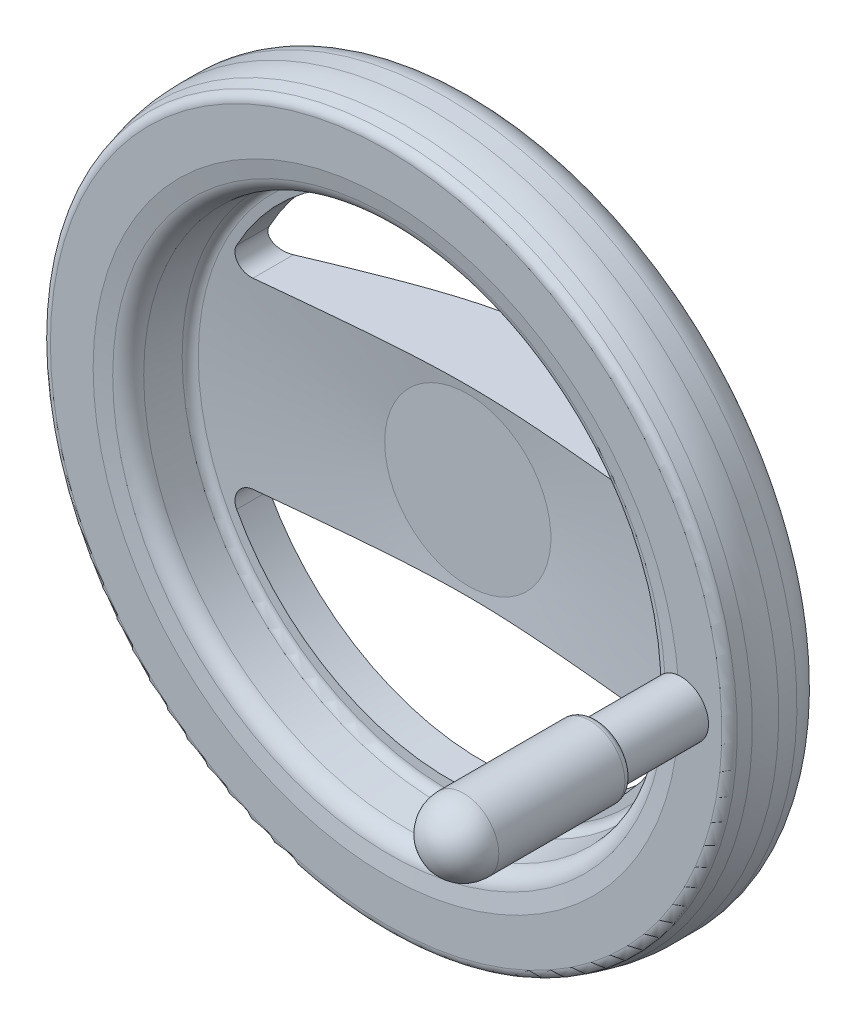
ISO-10303-21;
HEADER;
FILE_DESCRIPTION(('STEP AP214'),'2;1');
FILE_NAME('part.step','',(''),(''),'','','');
FILE_SCHEMA(('AUTOMOTIVE_DESIGN { 1 0 10303 214 1 1 1 1 }'));
ENDSEC;
DATA;
#1=APPLICATION_CONTEXT('core data for automotive mechanical design processes');
#2=APPLICATION_PROTOCOL_DEFINITION('international standard','automotive_design',2000,#1);
#3=PRODUCT_CONTEXT('',#1,'mechanical');
#4=PRODUCT('Part','Part','',(#3));
#5=PRODUCT_RELATED_PRODUCT_CATEGORY('part','',(#4));
#6=PRODUCT_DEFINITION_FORMATION('','',#4);
#7=PRODUCT_DEFINITION_CONTEXT('part definition',#1,'design');
#8=PRODUCT_DEFINITION('design','',#6,#7);
#9=PRODUCT_DEFINITION_SHAPE('','',#8);
#10=(LENGTH_UNIT() NAMED_UNIT(*) SI_UNIT(.MILLI.,.METRE.));
#11=(NAMED_UNIT(*) PLANE_ANGLE_UNIT() SI_UNIT($,.RADIAN.));
#12=(NAMED_UNIT(*) SI_UNIT($,.STERADIAN.) SOLID_ANGLE_UNIT());
#13=UNCERTAINTY_MEASURE_WITH_UNIT(LENGTH_MEASURE(1.E-05),#10,'distance_accuracy_value','');
#14=(GEOMETRIC_REPRESENTATION_CONTEXT(3) GLOBAL_UNCERTAINTY_ASSIGNED_CONTEXT((#13)) GLOBAL_UNIT_ASSIGNED_CONTEXT((#10,
#11,#12)) REPRESENTATION_CONTEXT('',''));
#15=CARTESIAN_POINT('',(0.,0.,0.));
#16=DIRECTION('',(0.,0.,1.));
#17=DIRECTION('',(1.,0.,0.));
#18=AXIS2_PLACEMENT_3D('',#15,#16,#17);
#19=CARTESIAN_POINT('',(0.,0.,37.39700342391));
#20=DIRECTION('',(0.,0.,1.));
#21=DIRECTION('',(-1.,0.,0.));
#22=AXIS2_PLACEMENT_3D('',#19,#20,#21);
#23=CONICAL_SURFACE('',#22,89.1316898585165,1.13322104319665);
#24=CARTESIAN_POINT('',(0.,0.,35.8674035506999));
#25=DIRECTION('',(0.,0.,1.));
#26=DIRECTION('',(-1.,0.,0.));
#27=AXIS2_PLACEMENT_3D('',#24,#25,#26);
#28=CIRCLE('',#27,85.8620689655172);
#29=CARTESIAN_POINT('',(-75.6568185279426,-40.5997622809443,35.8674035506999));
#30=VERTEX_POINT('',#29);
#31=CARTESIAN_POINT('',(75.6568184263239,-40.5997624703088,35.8674035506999));
#32=VERTEX_POINT('',#31);
#33=EDGE_CURVE('E478',#30,#32,#28,.T.);
#34=ORIENTED_EDGE('',*,*,#33,.T.);
#35=CARTESIAN_POINT('',(75.6568184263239,-40.5997624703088,35.8674035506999));
#36=CARTESIAN_POINT('',(75.7259149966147,-40.4710501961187,35.867412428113));
#37=CARTESIAN_POINT('',(75.7898717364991,-40.3395875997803,35.8648719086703));
#38=CARTESIAN_POINT('',(75.9071298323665,-40.0722124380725,35.8547573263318));
#39=CARTESIAN_POINT('',(75.9604334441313,-39.936300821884,35.8471843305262));
#40=CARTESIAN_POINT('',(76.0559014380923,-39.6614194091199,35.8270989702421));
#41=CARTESIAN_POINT('',(76.0980974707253,-39.5224595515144,35.8146008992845));
#42=CARTESIAN_POINT('',(76.1713480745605,-39.2421414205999,35.7847872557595));
#43=CARTESIAN_POINT('',(76.2024024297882,-39.1007831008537,35.7674715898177));
#44=CARTESIAN_POINT('',(76.2532628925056,-38.8167805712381,35.7281939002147));
#45=CARTESIAN_POINT('',(76.2730751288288,-38.6741371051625,35.7062344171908));
#46=CARTESIAN_POINT('',(76.3015082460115,-38.3884425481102,35.6578510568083));
#47=CARTESIAN_POINT('',(76.3101249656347,-38.2453913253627,35.6314255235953));
#48=CARTESIAN_POINT('',(76.3162822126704,-37.9599051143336,35.5743418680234));
#49=CARTESIAN_POINT('',(76.3138230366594,-37.8174701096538,35.5436838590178));
#50=CARTESIAN_POINT('',(76.2980488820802,-37.5340771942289,35.4783719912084));
#51=CARTESIAN_POINT('',(76.2847297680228,-37.3931198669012,35.4437166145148));
#52=CARTESIAN_POINT('',(76.2469201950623,-37.1090362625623,35.3694928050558));
#53=CARTESIAN_POINT('',(76.2220806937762,-36.9659884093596,35.3298012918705));
#54=CARTESIAN_POINT('',(76.1615435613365,-36.6832774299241,35.2467497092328));
#55=CARTESIAN_POINT('',(76.1258420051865,-36.5436155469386,35.2033883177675));
#56=CARTESIAN_POINT('',(76.0031022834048,-36.1309588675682,35.0682670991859));
#57=CARTESIAN_POINT('',(75.9004043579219,-35.8641131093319,34.9714230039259));
#58=CARTESIAN_POINT('',(75.6477891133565,-35.3324552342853,34.7586855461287));
#59=CARTESIAN_POINT('',(75.4947632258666,-35.0694966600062,34.6418894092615));
#60=CARTESIAN_POINT('',(75.1505301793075,-34.5749402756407,34.3986263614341));
#61=CARTESIAN_POINT('',(74.9593142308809,-34.3433497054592,34.2721572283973));
#62=CARTESIAN_POINT('',(74.5268123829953,-33.8977140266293,34.0015123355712));
#63=CARTESIAN_POINT('',(74.2826572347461,-33.6868168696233,33.8567441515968));
#64=CARTESIAN_POINT('',(73.7629781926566,-33.3111459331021,33.5627918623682));
#65=CARTESIAN_POINT('',(73.4874267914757,-33.146413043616,33.4136039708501));
#66=CARTESIAN_POINT('',(73.0475289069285,-32.9325717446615,33.1848797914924));
#67=CARTESIAN_POINT('',(72.8916036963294,-32.865461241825,33.1054761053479));
#68=CARTESIAN_POINT('',(72.574096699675,-32.7457873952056,32.9470559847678));
#69=CARTESIAN_POINT('',(72.4125168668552,-32.6932190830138,32.8680394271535));
#70=CARTESIAN_POINT('',(72.0850547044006,-32.603144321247,32.7110848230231));
#71=CARTESIAN_POINT('',(71.9191796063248,-32.5656141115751,32.6331452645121));
#72=CARTESIAN_POINT('',(71.5840581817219,-32.5059194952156,32.4788287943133));
#73=CARTESIAN_POINT('',(71.4148139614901,-32.4837457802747,32.402450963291));
#74=CARTESIAN_POINT('',(71.1675948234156,-32.4629708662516,32.2931802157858));
#75=CARTESIAN_POINT('',(71.090486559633,-32.4581112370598,32.259418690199));
#76=CARTESIAN_POINT('',(70.9360135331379,-32.4516280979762,32.1924311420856));
#77=CARTESIAN_POINT('',(70.858649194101,-32.4500006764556,32.1592045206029));
#78=CARTESIAN_POINT('',(70.7811567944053,-32.45,32.1262498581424));
#79=B_SPLINE_CURVE_WITH_KNOTS('',3,(#35,#36,#37,#38,#39,#40,#41,#42,#43,#44,#45,#46,#47,#48,#49,
#50,#51,#52,#53,#54,#55,#56,#57,#58,#59,#60,#61,#62,#63,#64,#65,#66,#67,#68,#69,#70,#71,#72,#73,
#74,#75,#76,#77,#78),.UNSPECIFIED.,.F.,.F.,(4,2,2,2,2,2,2,2,2,2,2,2,2,2,2,2,2,2,2,2,2,4),(0.,
0.438110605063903,0.876128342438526,1.31288412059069,1.74964836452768,2.18617426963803,
2.62286237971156,3.05953879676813,3.49638157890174,3.94742353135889,4.39862866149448,
5.3004821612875,6.27414117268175,7.24802452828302,8.30440265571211,9.36171353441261,
9.92339114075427,10.4848766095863,11.0454714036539,11.6057260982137,11.8586196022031,
12.1112068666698),.UNSPECIFIED.);
#80=CARTESIAN_POINT('',(70.7811567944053,-32.45,32.1262498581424));
#81=VERTEX_POINT('',#80);
#82=EDGE_CURVE('E289',#32,#81,#79,.T.);
#83=ORIENTED_EDGE('',*,*,#82,.T.);
#84=CARTESIAN_POINT('',(70.7811567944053,-32.45,32.1262498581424));
#85=CARTESIAN_POINT('',(69.7404921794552,-32.45,31.6837079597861));
#86=CARTESIAN_POINT('',(68.6992240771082,-32.45,31.2425816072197));
#87=CARTESIAN_POINT('',(66.6153218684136,-32.45,30.3635557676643));
#88=CARTESIAN_POINT('',(65.5726877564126,-32.45,29.92565629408));
#89=CARTESIAN_POINT('',(63.4858025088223,-32.45,29.0534416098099));
#90=CARTESIAN_POINT('',(62.4415512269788,-32.45,28.6191267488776));
#91=CARTESIAN_POINT('',(60.3513491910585,-32.45,27.7546068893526));
#92=CARTESIAN_POINT('',(59.3053984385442,-32.45,27.324401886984));
#93=CARTESIAN_POINT('',(57.2071428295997,-32.45,26.4668470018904));
#94=CARTESIAN_POINT('',(56.154829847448,-32.45,26.0395169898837));
#95=CARTESIAN_POINT('',(54.0480335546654,-32.45,25.1902418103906));
#96=CARTESIAN_POINT('',(52.9935502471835,-32.45,24.7682966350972));
#97=CARTESIAN_POINT('',(50.8821729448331,-32.45,23.9306065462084));
#98=CARTESIAN_POINT('',(49.8252790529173,-32.45,23.5148613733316));
#99=CARTESIAN_POINT('',(47.7087097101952,-32.45,22.6905056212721));
#100=CARTESIAN_POINT('',(46.6490342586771,-32.45,22.2818950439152));
#101=CARTESIAN_POINT('',(44.4862360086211,-32.45,21.4575923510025));
#102=CARTESIAN_POINT('',(43.3829910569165,-32.45,21.0422203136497));
#103=CARTESIAN_POINT('',(41.1726138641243,-32.45,20.2219279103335));
#104=CARTESIAN_POINT('',(40.0654816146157,-32.45,19.8170075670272));
#105=CARTESIAN_POINT('',(37.8466046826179,-32.45,19.0194276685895));
#106=CARTESIAN_POINT('',(36.7348593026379,-32.45,18.6267700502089));
#107=CARTESIAN_POINT('',(34.5063097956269,-32.45,17.8560631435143));
#108=CARTESIAN_POINT('',(33.3895056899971,-32.45,17.4780137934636));
#109=CARTESIAN_POINT('',(31.1517813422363,-32.45,16.7398373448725));
#110=CARTESIAN_POINT('',(30.0308694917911,-32.45,16.3796848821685));
#111=CARTESIAN_POINT('',(27.782559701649,-32.45,15.6800590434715));
#112=CARTESIAN_POINT('',(26.6551616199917,-32.45,15.3405861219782));
#113=CARTESIAN_POINT('',(24.3935025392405,-32.45,14.6864583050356));
#114=CARTESIAN_POINT('',(23.2592435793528,-32.45,14.3717963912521));
#115=CARTESIAN_POINT('',(20.9829891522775,-32.45,13.7719832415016));
#116=CARTESIAN_POINT('',(19.8409942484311,-32.45,13.4868298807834));
#117=CARTESIAN_POINT('',(17.5843177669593,-32.45,12.9598207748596));
#118=CARTESIAN_POINT('',(16.4698872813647,-32.45,12.7168966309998));
#119=CARTESIAN_POINT('',(14.2332808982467,-32.45,12.2694451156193));
#120=CARTESIAN_POINT('',(13.1111050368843,-32.45,12.0649175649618));
#121=CARTESIAN_POINT('',(10.8601477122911,-32.45,11.7000729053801));
#122=CARTESIAN_POINT('',(9.73137010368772,-32.45,11.5397322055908));
#123=CARTESIAN_POINT('',(7.46779314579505,-32.45,11.2684820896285));
#124=CARTESIAN_POINT('',(6.33299391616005,-32.45,11.1575716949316));
#125=CARTESIAN_POINT('',(4.63571313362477,-32.45,11.0320063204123));
#126=CARTESIAN_POINT('',(4.07467860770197,-32.45,10.9970568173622));
#127=CARTESIAN_POINT('',(2.95194216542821,-32.45,10.9405235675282));
#128=CARTESIAN_POINT('',(2.39024027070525,-32.45,10.9189393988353));
#129=CARTESIAN_POINT('',(1.26646724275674,-32.45,10.8893641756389));
#130=CARTESIAN_POINT('',(0.70439610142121,-32.45,10.8813734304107));
#131=CARTESIAN_POINT('',(-0.419758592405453,-32.45,10.8790670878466));
#132=CARTESIAN_POINT('',(-0.981842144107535,-32.45,10.8847511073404));
#133=CARTESIAN_POINT('',(-2.10573030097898,-32.45,10.9097369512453));
#134=CARTESIAN_POINT('',(-2.66753489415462,-32.45,10.9290393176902));
#135=CARTESIAN_POINT('',(-3.79050745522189,-32.45,10.9810557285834));
#136=CARTESIAN_POINT('',(-4.35167542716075,-32.45,11.0137696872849));
#137=CARTESIAN_POINT('',(-6.03379537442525,-32.45,11.131572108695));
#138=CARTESIAN_POINT('',(-7.15342185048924,-32.45,11.2363224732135));
#139=CARTESIAN_POINT('',(-9.40937779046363,-32.45,11.4969491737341));
#140=CARTESIAN_POINT('',(-10.5455913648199,-32.45,11.6538096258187));
#141=CARTESIAN_POINT('',(-12.8109614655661,-32.45,12.0126717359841));
#142=CARTESIAN_POINT('',(-13.9401170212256,-32.45,12.2146794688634));
#143=CARTESIAN_POINT('',(-16.1912984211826,-32.45,12.6581501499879));
#144=CARTESIAN_POINT('',(-17.313319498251,-32.45,12.8996370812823));
#145=CARTESIAN_POINT('',(-19.5494865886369,-32.45,13.4163023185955));
#146=CARTESIAN_POINT('',(-20.6636328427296,-32.45,13.6914795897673));
#147=CARTESIAN_POINT('',(-22.8878156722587,-32.45,14.2712467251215));
#148=CARTESIAN_POINT('',(-23.9978295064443,-32.45,14.5759233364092));
#149=CARTESIAN_POINT('',(-26.2109164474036,-32.45,15.2094374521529));
#150=CARTESIAN_POINT('',(-27.3139895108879,-32.45,15.538275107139));
#151=CARTESIAN_POINT('',(-29.5135556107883,-32.45,16.2161527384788));
#152=CARTESIAN_POINT('',(-30.6100503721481,-32.45,16.5651871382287));
#153=CARTESIAN_POINT('',(-32.7974428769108,-32.45,17.2803121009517));
#154=CARTESIAN_POINT('',(-33.8883406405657,-32.45,17.6464026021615));
#155=CARTESIAN_POINT('',(-36.0835505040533,-32.45,18.3992628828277));
#156=CARTESIAN_POINT('',(-37.1877785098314,-32.45,18.7862773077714));
#157=CARTESIAN_POINT('',(-39.3917450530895,-32.45,19.5728615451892));
#158=CARTESIAN_POINT('',(-40.4914835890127,-32.45,19.9724313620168));
#159=CARTESIAN_POINT('',(-42.687053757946,-32.45,20.7822328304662));
#160=CARTESIAN_POINT('',(-43.7828852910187,-32.45,21.1924647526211));
#161=CARTESIAN_POINT('',(-45.9710993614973,-32.45,22.0220121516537));
#162=CARTESIAN_POINT('',(-47.0634819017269,-32.45,22.4413276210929));
#163=CARTESIAN_POINT('',(-49.2435440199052,-32.45,23.2870959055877));
#164=CARTESIAN_POINT('',(-50.3312282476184,-32.45,23.7135367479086));
#165=CARTESIAN_POINT('',(-52.5039460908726,-32.45,24.5731130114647));
#166=CARTESIAN_POINT('',(-53.5889797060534,-32.45,25.0062484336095));
#167=CARTESIAN_POINT('',(-55.7566868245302,-32.45,25.8783120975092));
#168=CARTESIAN_POINT('',(-56.839360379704,-32.45,26.3172402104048));
#169=CARTESIAN_POINT('',(-59.0026445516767,-32.45,27.2001512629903));
#170=CARTESIAN_POINT('',(-60.0832551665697,-32.45,27.6441342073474));
#171=CARTESIAN_POINT('',(-61.9694727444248,-32.45,28.4236345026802));
#172=CARTESIAN_POINT('',(-62.7754842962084,-32.45,28.7581736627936));
#173=CARTESIAN_POINT('',(-64.3867048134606,-32.45,29.4295521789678));
#174=CARTESIAN_POINT('',(-65.1919136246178,-32.45,29.7663919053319));
#175=CARTESIAN_POINT('',(-66.7949692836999,-32.45,30.4393838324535));
#176=CARTESIAN_POINT('',(-67.5928230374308,-32.45,30.7755195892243));
#177=CARTESIAN_POINT('',(-69.1876218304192,-32.45,31.4495755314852));
#178=CARTESIAN_POINT('',(-69.9845669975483,-32.45,31.7874954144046));
#179=CARTESIAN_POINT('',(-70.7811567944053,-32.45,32.1262498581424));
#180=B_SPLINE_CURVE_WITH_KNOTS('',3,(#84,#85,#86,#87,#88,#89,#90,#91,#92,#93,#94,#95,#96,#97,
#98,#99,#100,#101,#102,#103,#104,#105,#106,#107,#108,#109,#110,#111,#112,#113,#114,#115,#116,
#117,#118,#119,#120,#121,#122,#123,#124,#125,#126,#127,#128,#129,#130,#131,#132,#133,#134,#135,
#136,#137,#138,#139,#140,#141,#142,#143,#144,#145,#146,#147,#148,#149,#150,#151,#152,#153,#154,
#155,#156,#157,#158,#159,#160,#161,#162,#163,#164,#165,#166,#167,#168,#169,#170,#171,#172,#173,
#174,#175,#176,#177,#178,#179),.UNSPECIFIED.,.F.,.F.,(4,2,2,2,2,2,2,2,2,2,2,2,2,2,2,2,2,2,2,2,2,
2,2,2,2,2,2,2,2,2,2,2,2,2,2,2,2,2,2,2,2,2,2,2,2,2,2,4),(0.,3.39255694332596,6.78512797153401,
10.1780261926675,13.5709212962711,16.9782184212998,20.3855106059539,23.7926598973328,
27.1998100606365,30.7363100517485,34.2728177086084,37.8098811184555,41.346929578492,
44.878813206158,48.4107744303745,51.9417329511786,55.4724370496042,58.8936610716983,
62.3148691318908,65.7342470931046,69.1535573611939,70.8397913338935,72.5259720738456,
74.2121911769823,75.8983630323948,77.584602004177,79.2708301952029,82.6431112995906,
86.0830893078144,89.5235304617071,92.9660694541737,96.4085027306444,99.8613856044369,
103.314289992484,106.766245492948,110.218188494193,113.728355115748,117.238522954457,
120.748779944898,124.259034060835,127.76388789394,131.268742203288,134.77351867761,
138.278298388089,140.89633620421,143.514805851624,146.112113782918,148.708994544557),.UNSPECIFIED.);
#181=CARTESIAN_POINT('',(-70.7811567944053,-32.45,32.1262498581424));
#182=VERTEX_POINT('',#181);
#183=EDGE_CURVE('E431',#81,#182,#180,.T.);
#184=ORIENTED_EDGE('',*,*,#183,.T.);
#185=CARTESIAN_POINT('',(-70.7811567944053,-32.45,32.1262498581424));
#186=CARTESIAN_POINT('',(-70.9531954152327,-32.449993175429,32.1994121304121));
#187=CARTESIAN_POINT('',(-71.1246298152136,-32.458022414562,32.2739259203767));
#188=CARTESIAN_POINT('',(-71.4650714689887,-32.489770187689,32.4250201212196));
#189=CARTESIAN_POINT('',(-71.6340793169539,-32.5134848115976,32.5016000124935));
#190=CARTESIAN_POINT('',(-71.968411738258,-32.5761975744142,32.6561695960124));
#191=CARTESIAN_POINT('',(-72.1337389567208,-32.6151843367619,32.734158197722));
#192=CARTESIAN_POINT('',(-72.4597863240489,-32.7080398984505,32.891047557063));
#193=CARTESIAN_POINT('',(-72.6205048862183,-32.761913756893,32.9699486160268));
#194=CARTESIAN_POINT('',(-72.936085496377,-32.8840521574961,33.1280213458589));
#195=CARTESIAN_POINT('',(-73.0909514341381,-32.9523069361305,33.2071927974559));
#196=CARTESIAN_POINT('',(-73.3938778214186,-33.1027528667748,33.3653131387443));
#197=CARTESIAN_POINT('',(-73.5419383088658,-33.1849439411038,33.4442620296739));
#198=CARTESIAN_POINT('',(-73.8302410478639,-33.3627752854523,33.6014229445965));
#199=CARTESIAN_POINT('',(-73.9704809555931,-33.4584195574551,33.679634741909));
#200=CARTESIAN_POINT('',(-74.2419846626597,-33.6625369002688,33.8347316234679));
#201=CARTESIAN_POINT('',(-74.3732517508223,-33.7710052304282,33.9116171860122));
#202=CARTESIAN_POINT('',(-74.6271438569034,-34.0013920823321,34.0643588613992));
#203=CARTESIAN_POINT('',(-74.7496622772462,-34.1234412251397,34.1401953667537));
#204=CARTESIAN_POINT('',(-74.9833411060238,-34.3792493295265,34.2893928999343));
#205=CARTESIAN_POINT('',(-75.0945064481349,-34.5130031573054,34.3627549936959));
#206=CARTESIAN_POINT('',(-75.304473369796,-34.7914986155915,34.5064920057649));
#207=CARTESIAN_POINT('',(-75.4032695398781,-34.9362450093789,34.5768656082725));
#208=CARTESIAN_POINT('',(-75.5872856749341,-35.2356506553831,34.7139657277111));
#209=CARTESIAN_POINT('',(-75.6725125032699,-35.3903048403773,34.7806940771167));
#210=CARTESIAN_POINT('',(-75.8243789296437,-35.7003639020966,34.9066341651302));
#211=CARTESIAN_POINT('',(-75.8917451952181,-35.8553275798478,34.9660557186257));
#212=CARTESIAN_POINT('',(-76.0124032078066,-36.1721051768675,35.0805519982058));
#213=CARTESIAN_POINT('',(-76.065701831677,-36.3339157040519,35.1356288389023));
#214=CARTESIAN_POINT('',(-76.1574218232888,-36.6631988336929,35.2409274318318));
#215=CARTESIAN_POINT('',(-76.195846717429,-36.8306700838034,35.2911503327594));
#216=CARTESIAN_POINT('',(-76.2570914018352,-37.1699323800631,35.3862324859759));
#217=CARTESIAN_POINT('',(-76.2799129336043,-37.3417229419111,35.4310923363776));
#218=CARTESIAN_POINT('',(-76.3080355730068,-37.6727237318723,35.5112263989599));
#219=CARTESIAN_POINT('',(-76.3147117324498,-37.8316975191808,35.5469979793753));
#220=CARTESIAN_POINT('',(-76.3142573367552,-38.1507041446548,35.6133164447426));
#221=CARTESIAN_POINT('',(-76.3071283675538,-38.3107368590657,35.643863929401));
#222=CARTESIAN_POINT('',(-76.2788668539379,-38.6303806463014,35.6993867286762));
#223=CARTESIAN_POINT('',(-76.2577482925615,-38.789991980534,35.7243675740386));
#224=CARTESIAN_POINT('',(-76.2014981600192,-39.1074686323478,35.7685102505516));
#225=CARTESIAN_POINT('',(-76.1663708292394,-39.2653344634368,35.7876738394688));
#226=CARTESIAN_POINT('',(-76.0694137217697,-39.6254565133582,35.8248695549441));
#227=CARTESIAN_POINT('',(-76.0027171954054,-39.826660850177,35.8407973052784));
#228=CARTESIAN_POINT('',(-75.8856099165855,-40.1219268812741,35.8567469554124));
#229=CARTESIAN_POINT('',(-75.8437288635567,-40.2192616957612,35.8607398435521));
#230=CARTESIAN_POINT('',(-75.7544071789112,-40.4114567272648,35.8660684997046));
#231=CARTESIAN_POINT('',(-75.7069648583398,-40.5063161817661,35.8674034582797));
#232=CARTESIAN_POINT('',(-75.6568186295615,-40.5997620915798,35.8674035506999));
#233=B_SPLINE_CURVE_WITH_KNOTS('',3,(#185,#186,#187,#188,#189,#190,#191,#192,#193,#194,#195,
#196,#197,#198,#199,#200,#201,#202,#203,#204,#205,#206,#207,#208,#209,#210,#211,#212,#213,#214,
#215,#216,#217,#218,#219,#220,#221,#222,#223,#224,#225,#226,#227,#228,#229,#230,#231,#232),
.UNSPECIFIED.,.F.,.F.,(4,2,2,2,2,2,2,2,2,2,2,2,2,2,2,2,2,2,2,2,2,2,2,4),(0.,0.560630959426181,
1.1211222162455,1.68119674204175,2.24146183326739,2.80134776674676,3.3612305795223,
3.92128029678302,4.48112362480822,5.04691317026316,5.61245578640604,6.17824487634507,
6.74374687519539,7.28038575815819,7.81676182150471,8.35301063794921,8.88919959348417,
9.37780697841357,9.86635823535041,10.3544219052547,10.8423379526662,11.4781749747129,
11.796112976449,12.1141477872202),.UNSPECIFIED.);
#234=EDGE_CURVE('E416',#182,#30,#233,.T.);
#235=ORIENTED_EDGE('',*,*,#234,.T.);
#236=EDGE_LOOP('',(#34,#83,#184,#235));
#237=FACE_BOUND('',#236,.T.);
#238=CARTESIAN_POINT('',(0.,0.,37.39700342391));
#239=DIRECTION('',(0.,0.,-1.));
#240=DIRECTION('',(0.,1.,0.));
#241=AXIS2_PLACEMENT_3D('',#238,#239,#240);
#242=CIRCLE('',#241,89.1316898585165);
#243=CARTESIAN_POINT('',(0.,89.1316898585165,37.39700342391));
#244=VERTEX_POINT('',#243);
#245=EDGE_CURVE('E282',#244,#244,#242,.T.);
#246=ORIENTED_EDGE('',*,*,#245,.T.);
#247=EDGE_LOOP('',(#246));
#248=FACE_BOUND('',#247,.T.);
#249=CARTESIAN_POINT('',(-70.7811567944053,32.45,32.1262498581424));
#250=CARTESIAN_POINT('',(-69.7404921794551,32.45,31.6837079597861));
#251=CARTESIAN_POINT('',(-68.6992240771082,32.45,31.2425816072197));
#252=CARTESIAN_POINT('',(-66.6153218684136,32.45,30.3635557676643));
#253=CARTESIAN_POINT('',(-65.5726877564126,32.45,29.92565629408));
#254=CARTESIAN_POINT('',(-63.4858025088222,32.45,29.0534416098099));
#255=CARTESIAN_POINT('',(-62.4415512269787,32.45,28.6191267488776));
#256=CARTESIAN_POINT('',(-60.3513491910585,32.45,27.7546068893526));
#257=CARTESIAN_POINT('',(-59.3053984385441,32.45,27.324401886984));
#258=CARTESIAN_POINT('',(-57.2071428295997,32.45,26.4668470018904));
#259=CARTESIAN_POINT('',(-56.154829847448,32.45,26.0395169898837));
#260=CARTESIAN_POINT('',(-54.0480335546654,32.45,25.1902418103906));
#261=CARTESIAN_POINT('',(-52.9935502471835,32.45,24.7682966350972));
#262=CARTESIAN_POINT('',(-50.8821729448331,32.45,23.9306065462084));
#263=CARTESIAN_POINT('',(-49.8252790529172,32.45,23.5148613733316));
#264=CARTESIAN_POINT('',(-47.7087097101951,32.45,22.6905056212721));
#265=CARTESIAN_POINT('',(-46.6490342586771,32.45,22.2818950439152));
#266=CARTESIAN_POINT('',(-44.4862360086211,32.45,21.4575923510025));
#267=CARTESIAN_POINT('',(-43.3829910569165,32.45,21.0422203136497));
#268=CARTESIAN_POINT('',(-41.1726138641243,32.45,20.2219279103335));
#269=CARTESIAN_POINT('',(-40.0654816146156,32.45,19.8170075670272));
#270=CARTESIAN_POINT('',(-37.8466046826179,32.45,19.0194276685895));
#271=CARTESIAN_POINT('',(-36.7348593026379,32.45,18.6267700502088));
#272=CARTESIAN_POINT('',(-34.5063097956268,32.45,17.8560631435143));
#273=CARTESIAN_POINT('',(-33.3895056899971,32.45,17.4780137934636));
#274=CARTESIAN_POINT('',(-31.1517813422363,32.45,16.7398373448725));
#275=CARTESIAN_POINT('',(-30.0308694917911,32.45,16.3796848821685));
#276=CARTESIAN_POINT('',(-27.7825597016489,32.45,15.6800590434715));
#277=CARTESIAN_POINT('',(-26.6551616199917,32.45,15.3405861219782));
#278=CARTESIAN_POINT('',(-24.3935025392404,32.45,14.6864583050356));
#279=CARTESIAN_POINT('',(-23.2592435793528,32.45,14.3717963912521));
#280=CARTESIAN_POINT('',(-20.9829891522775,32.45,13.7719832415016));
#281=CARTESIAN_POINT('',(-19.8409942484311,32.45,13.4868298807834));
#282=CARTESIAN_POINT('',(-17.5843177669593,32.45,12.9598207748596));
#283=CARTESIAN_POINT('',(-16.4698872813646,32.45,12.7168966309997));
#284=CARTESIAN_POINT('',(-14.2332808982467,32.45,12.2694451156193));
#285=CARTESIAN_POINT('',(-13.1111050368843,32.45,12.0649175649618));
#286=CARTESIAN_POINT('',(-10.8601477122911,32.45,11.7000729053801));
#287=CARTESIAN_POINT('',(-9.73137010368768,32.45,11.5397322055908));
#288=CARTESIAN_POINT('',(-7.46779314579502,32.45,11.2684820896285));
#289=CARTESIAN_POINT('',(-6.33299391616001,32.45,11.1575716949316));
#290=CARTESIAN_POINT('',(-4.63571313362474,32.45,11.0320063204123));
#291=CARTESIAN_POINT('',(-4.07467860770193,32.45,10.9970568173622));
#292=CARTESIAN_POINT('',(-2.95194216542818,32.45,10.9405235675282));
#293=CARTESIAN_POINT('',(-2.39024027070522,32.45,10.9189393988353));
#294=CARTESIAN_POINT('',(-1.26646724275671,32.45,10.8893641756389));
#295=CARTESIAN_POINT('',(-0.704396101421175,32.45,10.8813734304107));
#296=CARTESIAN_POINT('',(0.419758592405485,32.45,10.8790670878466));
#297=CARTESIAN_POINT('',(0.981842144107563,32.45,10.8847511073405));
#298=CARTESIAN_POINT('',(2.10573030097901,32.45,10.9097369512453));
#299=CARTESIAN_POINT('',(2.66753489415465,32.45,10.9290393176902));
#300=CARTESIAN_POINT('',(3.79050745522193,32.45,10.9810557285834));
#301=CARTESIAN_POINT('',(4.35167542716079,32.45,11.0137696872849));
#302=CARTESIAN_POINT('',(6.03379537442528,32.45,11.131572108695));
#303=CARTESIAN_POINT('',(7.15342185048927,32.45,11.2363224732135));
#304=CARTESIAN_POINT('',(9.40937779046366,32.45,11.4969491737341));
#305=CARTESIAN_POINT('',(10.54559136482,32.45,11.6538096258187));
#306=CARTESIAN_POINT('',(12.8109614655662,32.45,12.0126717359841));
#307=CARTESIAN_POINT('',(13.9401170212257,32.45,12.2146794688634));
#308=CARTESIAN_POINT('',(16.1912984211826,32.45,12.6581501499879));
#309=CARTESIAN_POINT('',(17.313319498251,32.45,12.8996370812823));
#310=CARTESIAN_POINT('',(19.5494865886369,32.45,13.4163023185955));
#311=CARTESIAN_POINT('',(20.6636328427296,32.45,13.6914795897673));
#312=CARTESIAN_POINT('',(22.8878156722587,32.45,14.2712467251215));
#313=CARTESIAN_POINT('',(23.9978295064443,32.45,14.5759233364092));
#314=CARTESIAN_POINT('',(26.2109164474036,32.45,15.2094374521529));
#315=CARTESIAN_POINT('',(27.313989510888,32.45,15.538275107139));
#316=CARTESIAN_POINT('',(29.5135556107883,32.45,16.2161527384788));
#317=CARTESIAN_POINT('',(30.6100503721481,32.45,16.5651871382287));
#318=CARTESIAN_POINT('',(32.7974428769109,32.45,17.2803121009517));
#319=CARTESIAN_POINT('',(33.8883406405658,32.45,17.6464026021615));
#320=CARTESIAN_POINT('',(36.0835505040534,32.45,18.3992628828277));
#321=CARTESIAN_POINT('',(37.1877785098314,32.45,18.7862773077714));
#322=CARTESIAN_POINT('',(39.3917450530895,32.45,19.5728615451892));
#323=CARTESIAN_POINT('',(40.4914835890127,32.45,19.9724313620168));
#324=CARTESIAN_POINT('',(42.6870537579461,32.45,20.7822328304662));
#325=CARTESIAN_POINT('',(43.7828852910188,32.45,21.1924647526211));
#326=CARTESIAN_POINT('',(45.9710993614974,32.45,22.0220121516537));
#327=CARTESIAN_POINT('',(47.0634819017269,32.45,22.4413276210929));
#328=CARTESIAN_POINT('',(49.2435440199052,32.45,23.2870959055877));
#329=CARTESIAN_POINT('',(50.3312282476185,32.45,23.7135367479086));
#330=CARTESIAN_POINT('',(52.5039460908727,32.45,24.5731130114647));
#331=CARTESIAN_POINT('',(53.5889797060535,32.45,25.0062484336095));
#332=CARTESIAN_POINT('',(55.7566868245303,32.45,25.8783120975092));
#333=CARTESIAN_POINT('',(56.8393603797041,32.45,26.3172402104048));
#334=CARTESIAN_POINT('',(59.0026445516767,32.45,27.2001512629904));
#335=CARTESIAN_POINT('',(60.0832551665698,32.45,27.6441342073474));
#336=CARTESIAN_POINT('',(61.9694727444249,32.45,28.4236345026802));
#337=CARTESIAN_POINT('',(62.7754842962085,32.45,28.7581736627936));
#338=CARTESIAN_POINT('',(64.3867048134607,32.45,29.4295521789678));
#339=CARTESIAN_POINT('',(65.1919136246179,32.45,29.766391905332));
#340=CARTESIAN_POINT('',(66.7949692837,32.45,30.4393838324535));
#341=CARTESIAN_POINT('',(67.5928230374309,32.45,30.7755195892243));
#342=CARTESIAN_POINT('',(69.1876218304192,32.45,31.4495755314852));
#343=CARTESIAN_POINT('',(69.9845669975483,32.45,31.7874954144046));
#344=CARTESIAN_POINT('',(70.7811567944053,32.45,32.1262498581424));
#345=B_SPLINE_CURVE_WITH_KNOTS('',3,(#249,#250,#251,#252,#253,#254,#255,#256,#257,#258,#259,
#260,#261,#262,#263,#264,#265,#266,#267,#268,#269,#270,#271,#272,#273,#274,#275,#276,#277,#278,
#279,#280,#281,#282,#283,#284,#285,#286,#287,#288,#289,#290,#291,#292,#293,#294,#295,#296,#297,
#298,#299,#300,#301,#302,#303,#304,#305,#306,#307,#308,#309,#310,#311,#312,#313,#314,#315,#316,
#317,#318,#319,#320,#321,#322,#323,#324,#325,#326,#327,#328,#329,#330,#331,#332,#333,#334,#335,
#336,#337,#338,#339,#340,#341,#342,#343,#344),.UNSPECIFIED.,.F.,.F.,(4,2,2,2,2,2,2,2,2,2,2,2,2,
2,2,2,2,2,2,2,2,2,2,2,2,2,2,2,2,2,2,2,2,2,2,2,2,2,2,2,2,2,2,2,2,2,2,4),(0.,3.39255694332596,
6.78512797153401,10.1780261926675,13.5709212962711,16.9782184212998,20.3855106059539,
23.7926598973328,27.1998100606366,30.7363100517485,34.2728177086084,37.8098811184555,
41.346929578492,44.878813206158,48.4107744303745,51.9417329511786,55.4724370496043,
58.8936610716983,62.3148691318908,65.7342470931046,69.1535573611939,70.8397913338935,
72.5259720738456,74.2121911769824,75.8983630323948,77.584602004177,79.2708301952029,
82.6431112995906,86.0830893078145,89.5235304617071,92.9660694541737,96.4085027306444,
99.8613856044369,103.314289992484,106.766245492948,110.218188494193,113.728355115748,
117.238522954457,120.748779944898,124.259034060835,127.76388789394,131.268742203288,
134.77351867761,138.278298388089,140.89633620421,143.514805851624,146.112113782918,
148.708994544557),.UNSPECIFIED.);
#346=CARTESIAN_POINT('',(-70.7811567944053,32.45,32.1262498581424));
#347=VERTEX_POINT('',#346);
#348=CARTESIAN_POINT('',(70.7811567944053,32.45,32.1262498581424));
#349=VERTEX_POINT('',#348);
#350=EDGE_CURVE('E403',#347,#349,#345,.T.);
#351=ORIENTED_EDGE('',*,*,#350,.T.);
#352=CARTESIAN_POINT('',(70.7811567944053,32.45,32.1262498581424));
#353=CARTESIAN_POINT('',(70.9531954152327,32.449993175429,32.1994121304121));
#354=CARTESIAN_POINT('',(71.1246298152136,32.458022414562,32.2739259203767));
#355=CARTESIAN_POINT('',(71.4650714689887,32.489770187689,32.4250201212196));
#356=CARTESIAN_POINT('',(71.6340793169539,32.5134848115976,32.5016000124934));
#357=CARTESIAN_POINT('',(71.968411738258,32.5761975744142,32.6561695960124));
#358=CARTESIAN_POINT('',(72.1337389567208,32.6151843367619,32.734158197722));
#359=CARTESIAN_POINT('',(72.4597863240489,32.7080398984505,32.891047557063));
#360=CARTESIAN_POINT('',(72.6205048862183,32.761913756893,32.9699486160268));
#361=CARTESIAN_POINT('',(72.936085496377,32.8840521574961,33.1280213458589));
#362=CARTESIAN_POINT('',(73.0909514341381,32.9523069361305,33.2071927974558));
#363=CARTESIAN_POINT('',(73.3938778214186,33.1027528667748,33.3653131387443));
#364=CARTESIAN_POINT('',(73.5419383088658,33.1849439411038,33.4442620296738));
#365=CARTESIAN_POINT('',(73.8302410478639,33.3627752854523,33.6014229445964));
#366=CARTESIAN_POINT('',(73.9704809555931,33.4584195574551,33.679634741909));
#367=CARTESIAN_POINT('',(74.2419846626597,33.6625369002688,33.8347316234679));
#368=CARTESIAN_POINT('',(74.3732517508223,33.7710052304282,33.9116171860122));
#369=CARTESIAN_POINT('',(74.6271438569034,34.0013920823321,34.0643588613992));
#370=CARTESIAN_POINT('',(74.7496622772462,34.1234412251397,34.1401953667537));
#371=CARTESIAN_POINT('',(74.9833411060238,34.3792493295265,34.2893928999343));
#372=CARTESIAN_POINT('',(75.0945064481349,34.5130031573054,34.3627549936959));
#373=CARTESIAN_POINT('',(75.304473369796,34.7914986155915,34.5064920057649));
#374=CARTESIAN_POINT('',(75.4032695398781,34.936245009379,34.5768656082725));
#375=CARTESIAN_POINT('',(75.5872856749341,35.2356506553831,34.7139657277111));
#376=CARTESIAN_POINT('',(75.67251250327,35.3903048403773,34.7806940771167));
#377=CARTESIAN_POINT('',(75.8243789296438,35.7003639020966,34.9066341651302));
#378=CARTESIAN_POINT('',(75.8917451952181,35.8553275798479,34.9660557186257));
#379=CARTESIAN_POINT('',(76.0124032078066,36.1721051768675,35.0805519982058));
#380=CARTESIAN_POINT('',(76.065701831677,36.3339157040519,35.1356288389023));
#381=CARTESIAN_POINT('',(76.1574218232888,36.6631988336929,35.2409274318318));
#382=CARTESIAN_POINT('',(76.195846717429,36.8306700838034,35.2911503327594));
#383=CARTESIAN_POINT('',(76.2570914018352,37.1699323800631,35.3862324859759));
#384=CARTESIAN_POINT('',(76.2799129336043,37.3417229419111,35.4310923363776));
#385=CARTESIAN_POINT('',(76.3080355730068,37.6727237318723,35.5112263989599));
#386=CARTESIAN_POINT('',(76.3147117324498,37.8316975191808,35.5469979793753));
#387=CARTESIAN_POINT('',(76.3142573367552,38.1507041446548,35.6133164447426));
#388=CARTESIAN_POINT('',(76.3071283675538,38.3107368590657,35.643863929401));
#389=CARTESIAN_POINT('',(76.2788668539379,38.6303806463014,35.6993867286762));
#390=CARTESIAN_POINT('',(76.2577482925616,38.789991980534,35.7243675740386));
#391=CARTESIAN_POINT('',(76.2014981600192,39.1074686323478,35.7685102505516));
#392=CARTESIAN_POINT('',(76.1663708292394,39.2653344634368,35.7876738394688));
#393=CARTESIAN_POINT('',(76.0694137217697,39.6254565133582,35.8248695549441));
#394=CARTESIAN_POINT('',(76.0027171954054,39.826660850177,35.8407973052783));
#395=CARTESIAN_POINT('',(75.8856099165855,40.1219268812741,35.8567469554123));
#396=CARTESIAN_POINT('',(75.8437288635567,40.2192616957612,35.8607398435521));
#397=CARTESIAN_POINT('',(75.7544071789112,40.4114567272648,35.8660684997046));
#398=CARTESIAN_POINT('',(75.7069648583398,40.506316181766,35.8674034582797));
#399=CARTESIAN_POINT('',(75.6568186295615,40.5997620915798,35.8674035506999));
#400=B_SPLINE_CURVE_WITH_KNOTS('',3,(#352,#353,#354,#355,#356,#357,#358,#359,#360,#361,#362,
#363,#364,#365,#366,#367,#368,#369,#370,#371,#372,#373,#374,#375,#376,#377,#378,#379,#380,#381,
#382,#383,#384,#385,#386,#387,#388,#389,#390,#391,#392,#393,#394,#395,#396,#397,#398,#399),
.UNSPECIFIED.,.F.,.F.,(4,2,2,2,2,2,2,2,2,2,2,2,2,2,2,2,2,2,2,2,2,2,2,4),(0.,0.560630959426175,
1.12112221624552,1.68119674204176,2.24146183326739,2.80134776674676,3.36123057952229,
3.92128029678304,4.48112362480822,5.04691317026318,5.61245578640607,6.17824487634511,
6.74374687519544,7.28038575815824,7.81676182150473,8.35301063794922,8.88919959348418,
9.37780697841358,9.86635823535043,10.3544219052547,10.8423379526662,11.4781749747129,
11.796112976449,12.1141477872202),.UNSPECIFIED.);
#401=CARTESIAN_POINT('',(75.6568185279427,40.5997622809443,35.8674035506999));
#402=VERTEX_POINT('',#401);
#403=EDGE_CURVE('E424',#349,#402,#400,.T.);
#404=ORIENTED_EDGE('',*,*,#403,.T.);
#405=CARTESIAN_POINT('',(0.,0.,35.8674035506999));
#406=DIRECTION('',(0.,0.,1.));
#407=DIRECTION('',(-1.,0.,0.));
#408=AXIS2_PLACEMENT_3D('',#405,#406,#407);
#409=CIRCLE('',#408,85.8620689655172);
#410=CARTESIAN_POINT('',(-75.6568184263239,40.5997624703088,35.8674035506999));
#411=VERTEX_POINT('',#410);
#412=EDGE_CURVE('E404',#402,#411,#409,.T.);
#413=ORIENTED_EDGE('',*,*,#412,.T.);
#414=CARTESIAN_POINT('',(-75.6568184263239,40.5997624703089,35.8674035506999));
#415=CARTESIAN_POINT('',(-75.7259149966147,40.4710501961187,35.867412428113));
#416=CARTESIAN_POINT('',(-75.7898717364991,40.3395875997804,35.8648719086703));
#417=CARTESIAN_POINT('',(-75.9071298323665,40.0722124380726,35.8547573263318));
#418=CARTESIAN_POINT('',(-75.9604334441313,39.9363008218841,35.8471843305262));
#419=CARTESIAN_POINT('',(-76.0559014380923,39.6614194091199,35.8270989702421));
#420=CARTESIAN_POINT('',(-76.0980974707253,39.5224595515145,35.8146008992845));
#421=CARTESIAN_POINT('',(-76.1713480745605,39.2421414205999,35.7847872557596));
#422=CARTESIAN_POINT('',(-76.2024024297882,39.1007831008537,35.7674715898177));
#423=CARTESIAN_POINT('',(-76.2532628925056,38.8167805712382,35.7281939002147));
#424=CARTESIAN_POINT('',(-76.2730751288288,38.6741371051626,35.7062344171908));
#425=CARTESIAN_POINT('',(-76.3015082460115,38.3884425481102,35.6578510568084));
#426=CARTESIAN_POINT('',(-76.3101249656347,38.2453913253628,35.6314255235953));
#427=CARTESIAN_POINT('',(-76.3162822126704,37.9599051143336,35.5743418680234));
#428=CARTESIAN_POINT('',(-76.3138230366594,37.8174701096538,35.5436838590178));
#429=CARTESIAN_POINT('',(-76.2980488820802,37.5340771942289,35.4783719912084));
#430=CARTESIAN_POINT('',(-76.2847297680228,37.3931198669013,35.4437166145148));
#431=CARTESIAN_POINT('',(-76.2469201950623,37.1090362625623,35.3694928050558));
#432=CARTESIAN_POINT('',(-76.2220806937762,36.9659884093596,35.3298012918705));
#433=CARTESIAN_POINT('',(-76.1615435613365,36.6832774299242,35.2467497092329));
#434=CARTESIAN_POINT('',(-76.1258420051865,36.5436155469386,35.2033883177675));
#435=CARTESIAN_POINT('',(-76.0031022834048,36.1309588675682,35.068267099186));
#436=CARTESIAN_POINT('',(-75.9004043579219,35.8641131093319,34.9714230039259));
#437=CARTESIAN_POINT('',(-75.6477891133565,35.3324552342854,34.7586855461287));
#438=CARTESIAN_POINT('',(-75.4947632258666,35.0694966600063,34.6418894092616));
#439=CARTESIAN_POINT('',(-75.1505301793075,34.5749402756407,34.3986263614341));
#440=CARTESIAN_POINT('',(-74.959314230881,34.3433497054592,34.2721572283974));
#441=CARTESIAN_POINT('',(-74.5268123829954,33.8977140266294,34.0015123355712));
#442=CARTESIAN_POINT('',(-74.2826572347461,33.6868168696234,33.8567441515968));
#443=CARTESIAN_POINT('',(-73.7629781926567,33.3111459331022,33.5627918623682));
#444=CARTESIAN_POINT('',(-73.4874267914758,33.146413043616,33.4136039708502));
#445=CARTESIAN_POINT('',(-73.0475289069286,32.9325717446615,33.1848797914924));
#446=CARTESIAN_POINT('',(-72.8916036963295,32.865461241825,33.105476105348));
#447=CARTESIAN_POINT('',(-72.574096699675,32.7457873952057,32.9470559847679));
#448=CARTESIAN_POINT('',(-72.4125168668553,32.6932190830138,32.8680394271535));
#449=CARTESIAN_POINT('',(-72.0850547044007,32.603144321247,32.7110848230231));
#450=CARTESIAN_POINT('',(-71.9191796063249,32.5656141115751,32.6331452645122));
#451=CARTESIAN_POINT('',(-71.584058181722,32.5059194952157,32.4788287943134));
#452=CARTESIAN_POINT('',(-71.4148139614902,32.4837457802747,32.402450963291));
#453=CARTESIAN_POINT('',(-71.1675948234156,32.4629708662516,32.2931802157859));
#454=CARTESIAN_POINT('',(-71.090486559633,32.4581112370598,32.259418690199));
#455=CARTESIAN_POINT('',(-70.9360135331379,32.4516280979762,32.1924311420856));
#456=CARTESIAN_POINT('',(-70.858649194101,32.4500006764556,32.1592045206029));
#457=CARTESIAN_POINT('',(-70.7811567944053,32.45,32.1262498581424));
#458=B_SPLINE_CURVE_WITH_KNOTS('',3,(#414,#415,#416,#417,#418,#419,#420,#421,#422,#423,#424,
#425,#426,#427,#428,#429,#430,#431,#432,#433,#434,#435,#436,#437,#438,#439,#440,#441,#442,#443,
#444,#445,#446,#447,#448,#449,#450,#451,#452,#453,#454,#455,#456,#457),.UNSPECIFIED.,.F.,.F.,(4,
2,2,2,2,2,2,2,2,2,2,2,2,2,2,2,2,2,2,2,2,4),(0.,0.438110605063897,0.876128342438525,
1.31288412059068,1.74964836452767,2.18617426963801,2.62286237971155,3.05953879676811,
3.49638157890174,3.94742353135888,4.39862866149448,5.3004821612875,6.27414117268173,
7.24802452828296,8.30440265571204,9.36171353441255,9.92339114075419,10.4848766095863,
11.0454714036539,11.6057260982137,11.8586196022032,12.1112068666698),.UNSPECIFIED.);
#459=EDGE_CURVE('E396',#411,#347,#458,.T.);
#460=ORIENTED_EDGE('',*,*,#459,.T.);
#461=EDGE_LOOP('',(#351,#404,#413,#460));
#462=FACE_BOUND('',#461,.T.);
#463=CARTESIAN_POINT('',(0.,0.,9.26608910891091));
#464=DIRECTION('',(0.,0.,-1.));
#465=DIRECTION('',(1.,0.,0.));
#466=AXIS2_PLACEMENT_3D('',#463,#464,#465);
#467=CIRCLE('',#466,29.);
#468=CARTESIAN_POINT('',(29.,0.,9.26608910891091));
#469=VERTEX_POINT('',#468);
#470=EDGE_CURVE('E88',#469,#469,#467,.T.);
#471=ORIENTED_EDGE('',*,*,#470,.F.);
#472=EDGE_LOOP('',(#471));
#473=FACE_BOUND('',#472,.T.);
#474=ADVANCED_FACE('F14',(#237,#248,#462,#473),#23,.T.);
#475=CARTESIAN_POINT('',(0.,0.,0.));
#476=DIRECTION('',(0.,0.,-1.));
#477=DIRECTION('',(0.,1.,0.));
#478=AXIS2_PLACEMENT_3D('',#475,#476,#477);
#479=CYLINDRICAL_SURFACE('',#478,85.8620689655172);
#480=DIRECTION('',(0.,0.,-1.));
#481=VECTOR('',#480,1.);
#482=CARTESIAN_POINT('',(-75.6568184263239,40.5997624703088,0.));
#483=LINE('',#482,#481);
#484=CARTESIAN_POINT('',(-75.6568184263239,40.5997624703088,47.417463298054));
#485=VERTEX_POINT('',#484);
#486=EDGE_CURVE('E384',#485,#411,#483,.T.);
#487=ORIENTED_EDGE('',*,*,#486,.T.);
#488=ORIENTED_EDGE('',*,*,#412,.F.);
#489=DIRECTION('',(0.,0.,-1.));
#490=VECTOR('',#489,1.);
#491=CARTESIAN_POINT('',(75.6568186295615,40.5997620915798,0.));
#492=LINE('',#491,#490);
#493=CARTESIAN_POINT('',(75.6568185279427,40.5997622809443,47.417463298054));
#494=VERTEX_POINT('',#493);
#495=EDGE_CURVE('E500',#402,#494,#492,.F.);
#496=ORIENTED_EDGE('',*,*,#495,.T.);
#497=CARTESIAN_POINT('',(0.,0.,47.4174632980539));
#498=DIRECTION('',(0.,0.,-1.));
#499=DIRECTION('',(0.,1.,0.));
#500=AXIS2_PLACEMENT_3D('',#497,#498,#499);
#501=CIRCLE('',#500,85.8620689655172);
#502=EDGE_CURVE('E512',#485,#494,#501,.T.);
#503=ORIENTED_EDGE('',*,*,#502,.F.);
#504=EDGE_LOOP('',(#487,#488,#496,#503));
#505=FACE_BOUND('',#504,.T.);
#506=ADVANCED_FACE('F392',(#505),#479,.F.);
#507=CARTESIAN_POINT('',(-70.7811567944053,37.9833333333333,0.));
#508=DIRECTION('',(0.,0.,-1.));
#509=DIRECTION('',(0.,1.,0.));
#510=AXIS2_PLACEMENT_3D('',#507,#508,#509);
#511=CYLINDRICAL_SURFACE('',#510,5.53333333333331);
#512=DIRECTION('',(0.,0.,1.));
#513=VECTOR('',#512,1.);
#514=CARTESIAN_POINT('',(-70.7811567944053,32.45,0.));
#515=LINE('',#514,#513);
#516=CARTESIAN_POINT('',(-70.7811567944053,32.45,46.5069179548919));
#517=VERTEX_POINT('',#516);
#518=EDGE_CURVE('E383',#517,#347,#515,.F.);
#519=ORIENTED_EDGE('',*,*,#518,.T.);
#520=ORIENTED_EDGE('',*,*,#459,.F.);
#521=ORIENTED_EDGE('',*,*,#486,.F.);
#522=CARTESIAN_POINT('',(-70.7811567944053,32.45,46.5069179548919));
#523=CARTESIAN_POINT('',(-70.9378156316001,32.4499836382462,46.5231321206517));
#524=CARTESIAN_POINT('',(-71.0944373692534,32.4566522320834,46.5396683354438));
#525=CARTESIAN_POINT('',(-71.4064893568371,32.4832235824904,46.57325442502));
#526=CARTESIAN_POINT('',(-71.5619196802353,32.503125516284,46.5903042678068));
#527=CARTESIAN_POINT('',(-71.870386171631,32.5560098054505,46.624777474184));
#528=CARTESIAN_POINT('',(-72.0234238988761,32.5889832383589,46.6422005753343));
#529=CARTESIAN_POINT('',(-72.3261286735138,32.6677623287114,46.6773017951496));
#530=CARTESIAN_POINT('',(-72.4757957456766,32.7135678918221,46.6949799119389));
#531=CARTESIAN_POINT('',(-72.7707318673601,32.8176937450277,46.7304662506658));
#532=CARTESIAN_POINT('',(-72.9159999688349,32.8760167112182,46.7482744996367));
#533=CARTESIAN_POINT('',(-73.2011277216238,33.0047796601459,46.7838965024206));
#534=CARTESIAN_POINT('',(-73.3409853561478,33.0752241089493,46.8017102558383));
#535=CARTESIAN_POINT('',(-73.6141633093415,33.2276730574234,46.8372011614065));
#536=CARTESIAN_POINT('',(-73.7474873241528,33.3096709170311,46.854878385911));
#537=CARTESIAN_POINT('',(-74.006782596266,33.4847120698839,46.8899907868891));
#538=CARTESIAN_POINT('',(-74.1327511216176,33.5777594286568,46.9074258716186));
#539=CARTESIAN_POINT('',(-74.3764321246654,33.7742619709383,46.9419356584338));
#540=CARTESIAN_POINT('',(-74.4941411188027,33.8777215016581,46.9590102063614));
#541=CARTESIAN_POINT('',(-74.7204405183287,34.0943279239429,46.9926826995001));
#542=CARTESIAN_POINT('',(-74.8290274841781,34.2074784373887,47.0092804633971));
#543=CARTESIAN_POINT('',(-75.0362257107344,34.4426108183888,47.0418788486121));
#544=CARTESIAN_POINT('',(-75.1348389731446,34.5645909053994,47.057879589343));
#545=CARTESIAN_POINT('',(-75.3214375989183,34.8165967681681,47.0891891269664));
#546=CARTESIAN_POINT('',(-75.4094181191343,34.9466261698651,47.1044976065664));
#547=CARTESIAN_POINT('',(-75.5738228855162,35.2133858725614,47.134273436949));
#548=CARTESIAN_POINT('',(-75.6502784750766,35.3500966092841,47.1487430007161));
#549=CARTESIAN_POINT('',(-75.7913264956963,35.6295155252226,47.1767869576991));
#550=CARTESIAN_POINT('',(-75.8559243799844,35.7722209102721,47.1903617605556));
#551=CARTESIAN_POINT('',(-75.9728262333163,36.0626928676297,47.216538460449));
#552=CARTESIAN_POINT('',(-76.0251283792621,36.2104601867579,47.2291402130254));
#553=CARTESIAN_POINT('',(-76.1170122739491,36.5099208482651,47.2532836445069));
#554=CARTESIAN_POINT('',(-76.1565988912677,36.6616126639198,47.2648257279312));
#555=CARTESIAN_POINT('',(-76.2226076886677,36.9671194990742,47.2867270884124));
#556=CARTESIAN_POINT('',(-76.2490947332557,37.1209201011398,47.297091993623));
#557=CARTESIAN_POINT('',(-76.288983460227,37.4302245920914,47.3166366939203));
#558=CARTESIAN_POINT('',(-76.3023900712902,37.5857278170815,47.325816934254));
#559=CARTESIAN_POINT('',(-76.3160251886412,37.8974856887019,47.3429454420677));
#560=CARTESIAN_POINT('',(-76.3162447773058,38.0537407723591,47.3508928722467));
#561=CARTESIAN_POINT('',(-76.3034688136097,38.3657131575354,47.3654961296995));
#562=CARTESIAN_POINT('',(-76.2904778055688,38.521430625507,47.3721524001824));
#563=CARTESIAN_POINT('',(-76.2497589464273,38.8439773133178,47.3846271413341));
#564=CARTESIAN_POINT('',(-76.2209099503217,39.0106705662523,47.3903321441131));
#565=CARTESIAN_POINT('',(-76.1480654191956,39.3407753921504,47.4001442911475));
#566=CARTESIAN_POINT('',(-76.104068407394,39.5041866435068,47.4042512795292));
#567=CARTESIAN_POINT('',(-76.0011940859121,39.826605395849,47.410842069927));
#568=CARTESIAN_POINT('',(-75.9422909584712,39.9856047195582,47.4133230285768));
#569=CARTESIAN_POINT('',(-75.8101643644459,40.2975561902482,47.416634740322));
#570=CARTESIAN_POINT('',(-75.7369407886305,40.4505082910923,47.4174654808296));
#571=CARTESIAN_POINT('',(-75.6568184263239,40.5997624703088,47.4174632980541));
#572=B_SPLINE_CURVE_WITH_KNOTS('',3,(#522,#523,#524,#525,#526,#527,#528,#529,#530,#531,#532,
#533,#534,#535,#536,#537,#538,#539,#540,#541,#542,#543,#544,#545,#546,#547,#548,#549,#550,#551,
#552,#553,#554,#555,#556,#557,#558,#559,#560,#561,#562,#563,#564,#565,#566,#567,#568,#569,#570,
#571),.UNSPECIFIED.,.F.,.F.,(4,2,2,2,2,2,2,2,2,2,2,2,2,2,2,2,2,2,2,2,2,2,2,2,4),(0.,
0.472340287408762,0.944651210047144,1.41664029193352,1.8886259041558,2.36071252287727,
2.83297345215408,3.30496405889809,3.77712887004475,4.24949164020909,4.72203172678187,
5.19447678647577,5.66713623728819,6.13848609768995,6.60961864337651,7.08082100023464,
7.55184272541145,8.02050816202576,8.48899693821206,8.95780252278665,9.42644689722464,
9.93352291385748,10.4406483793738,10.9486582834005,11.4566720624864),.UNSPECIFIED.);
#573=EDGE_CURVE('E375',#517,#485,#572,.T.);
#574=ORIENTED_EDGE('',*,*,#573,.F.);
#575=EDGE_LOOP('',(#519,#520,#521,#574));
#576=FACE_BOUND('',#575,.T.);
#577=ADVANCED_FACE('F387',(#576),#511,.F.);
#578=CARTESIAN_POINT('',(70.7811567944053,32.45,0.));
#579=DIRECTION('',(0.,-1.,0.));
#580=DIRECTION('',(1.,0.,0.));
#581=AXIS2_PLACEMENT_3D('',#578,#579,#580);
#582=PLANE('',#581);
#583=DIRECTION('',(0.,0.,-1.));
#584=VECTOR('',#583,1.);
#585=CARTESIAN_POINT('',(70.7811567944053,32.45,0.));
#586=LINE('',#585,#584);
#587=CARTESIAN_POINT('',(70.7811567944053,32.45,46.5069179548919));
#588=VERTEX_POINT('',#587);
#589=EDGE_CURVE('E503',#588,#349,#586,.T.);
#590=ORIENTED_EDGE('',*,*,#589,.T.);
#591=ORIENTED_EDGE('',*,*,#350,.F.);
#592=ORIENTED_EDGE('',*,*,#518,.F.);
#593=CARTESIAN_POINT('',(70.7811567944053,32.45,46.5069179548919));
#594=CARTESIAN_POINT('',(69.1576516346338,32.45,46.3388980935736));
#595=CARTESIAN_POINT('',(67.5340463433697,32.45,46.1718390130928));
#596=CARTESIAN_POINT('',(64.2865905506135,32.45,45.8400955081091));
#597=CARTESIAN_POINT('',(62.6627400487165,32.45,45.6754110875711));
#598=CARTESIAN_POINT('',(59.4147486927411,32.45,45.3488699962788));
#599=CARTESIAN_POINT('',(57.7906078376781,32.45,45.1870133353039));
#600=CARTESIAN_POINT('',(54.5419879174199,32.45,44.8667312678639));
#601=CARTESIAN_POINT('',(52.9175088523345,32.45,44.7083058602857));
#602=CARTESIAN_POINT('',(49.6640125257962,32.45,44.3952463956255));
#603=CARTESIAN_POINT('',(48.0349942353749,32.45,44.2406230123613));
#604=CARTESIAN_POINT('',(44.7764717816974,32.45,43.9365661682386));
#605=CARTESIAN_POINT('',(43.1469676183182,32.45,43.7871327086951));
#606=CARTESIAN_POINT('',(39.8873322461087,32.45,43.4947094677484));
#607=CARTESIAN_POINT('',(38.2572010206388,32.45,43.3517198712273));
#608=CARTESIAN_POINT('',(34.9962477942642,32.45,43.0738051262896));
#609=CARTESIAN_POINT('',(33.3654257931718,32.45,42.9388799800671));
#610=CARTESIAN_POINT('',(30.1131208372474,32.45,42.6799656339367));
#611=CARTESIAN_POINT('',(28.49164291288,32.45,42.5559136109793));
#612=CARTESIAN_POINT('',(25.2477678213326,32.45,42.320351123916));
#613=CARTESIAN_POINT('',(23.6253706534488,32.45,42.2088406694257));
#614=CARTESIAN_POINT('',(20.3796193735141,32.45,42.001441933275));
#615=CARTESIAN_POINT('',(18.7562652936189,32.45,41.9055531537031));
#616=CARTESIAN_POINT('',(15.508527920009,32.45,41.7329075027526));
#617=CARTESIAN_POINT('',(13.884144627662,32.45,41.6561506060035));
#618=CARTESIAN_POINT('',(10.6364367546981,32.45,41.5254716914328));
#619=CARTESIAN_POINT('',(9.0131133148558,32.45,41.471521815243));
#620=CARTESIAN_POINT('',(5.76580829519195,32.45,41.3894352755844));
#621=CARTESIAN_POINT('',(4.14182671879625,32.45,41.3612984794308));
#622=CARTESIAN_POINT('',(0.893675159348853,32.45,41.332693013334));
#623=CARTESIAN_POINT('',(-0.73049481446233,32.45,41.3322233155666));
#624=CARTESIAN_POINT('',(-3.97860428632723,32.45,41.3589859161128));
#625=CARTESIAN_POINT('',(-5.6025437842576,32.45,41.3862182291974));
#626=CARTESIAN_POINT('',(-8.55044320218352,32.45,41.4591620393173));
#627=CARTESIAN_POINT('',(-9.87451402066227,32.45,41.5005413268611));
#628=CARTESIAN_POINT('',(-12.5220850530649,32.45,41.5988804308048));
#629=CARTESIAN_POINT('',(-13.845585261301,32.45,41.6558403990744));
#630=CARTESIAN_POINT('',(-16.4919698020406,32.45,41.7834371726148));
#631=CARTESIAN_POINT('',(-17.8148541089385,32.45,41.8540745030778));
#632=CARTESIAN_POINT('',(-20.4599345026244,32.45,42.0070657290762));
#633=CARTESIAN_POINT('',(-21.7821305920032,32.45,42.0894195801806));
#634=CARTESIAN_POINT('',(-24.4272542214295,32.45,42.2641012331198));
#635=CARTESIAN_POINT('',(-25.7501810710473,32.45,42.3564394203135));
#636=CARTESIAN_POINT('',(-28.3954275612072,32.45,42.549388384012));
#637=CARTESIAN_POINT('',(-29.717747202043,32.45,42.649999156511));
#638=CARTESIAN_POINT('',(-32.3618113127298,32.45,42.8580989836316));
#639=CARTESIAN_POINT('',(-33.6835557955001,32.45,42.9655878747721));
#640=CARTESIAN_POINT('',(-36.3265655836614,32.45,43.1862846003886));
#641=CARTESIAN_POINT('',(-37.6478308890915,32.45,43.2994924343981));
#642=CARTESIAN_POINT('',(-40.2967537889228,32.45,43.5312663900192));
#643=CARTESIAN_POINT('',(-41.6244092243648,32.45,43.6498571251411));
#644=CARTESIAN_POINT('',(-44.2793557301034,32.45,43.8910563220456));
#645=CARTESIAN_POINT('',(-45.6066468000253,32.45,44.0136647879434));
#646=CARTESIAN_POINT('',(-48.2609195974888,32.45,44.2622529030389));
#647=CARTESIAN_POINT('',(-49.5879013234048,32.45,44.3882325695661));
#648=CARTESIAN_POINT('',(-52.2415918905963,32.45,44.6430348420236));
#649=CARTESIAN_POINT('',(-53.5683007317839,32.45,44.7718574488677));
#650=CARTESIAN_POINT('',(-56.2191538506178,32.45,45.0316857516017));
#651=CARTESIAN_POINT('',(-57.5432985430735,32.45,45.1626872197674));
#652=CARTESIAN_POINT('',(-60.1913834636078,32.45,45.4267412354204));
#653=CARTESIAN_POINT('',(-61.5153236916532,32.45,45.55979378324));
#654=CARTESIAN_POINT('',(-64.1630025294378,32.45,45.8276545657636));
#655=CARTESIAN_POINT('',(-65.4867411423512,32.45,45.9624627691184));
#656=CARTESIAN_POINT('',(-68.1340611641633,32.45,46.2336044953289));
#657=CARTESIAN_POINT('',(-69.4576425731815,32.45,46.3699380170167));
#658=CARTESIAN_POINT('',(-70.7811567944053,32.45,46.5069179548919));
#659=B_SPLINE_CURVE_WITH_KNOTS('',3,(#593,#594,#595,#596,#597,#598,#599,#600,#601,#602,#603,
#604,#605,#606,#607,#608,#609,#610,#611,#612,#613,#614,#615,#616,#617,#618,#619,#620,#621,#622,
#623,#624,#625,#626,#627,#628,#629,#630,#631,#632,#633,#634,#635,#636,#637,#638,#639,#640,#641,
#642,#643,#644,#645,#646,#647,#648,#649,#650,#651,#652,#653,#654,#655,#656,#657,#658),
.UNSPECIFIED.,.F.,.F.,(4,2,2,2,2,2,2,2,2,2,2,2,2,2,2,2,2,2,2,2,2,2,2,2,2,2,2,2,2,2,2,2,4),(0.,
4.89652983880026,9.79306785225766,14.6896227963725,19.5861761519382,24.4951898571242,
29.4042048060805,34.3133605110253,39.2225175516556,44.1011282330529,48.9797426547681,
53.8582015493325,58.7366539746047,63.6091301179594,68.4815812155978,73.3538513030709,
78.2261239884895,82.20017887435,86.1742724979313,90.148518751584,94.1227499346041,
98.1011554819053,102.079559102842,106.057868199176,110.036176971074,114.034993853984,
118.033814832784,122.03265637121,126.031499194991,130.0233246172,134.015150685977,
138.006905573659,141.998657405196),.UNSPECIFIED.);
#660=EDGE_CURVE('E368',#588,#517,#659,.T.);
#661=ORIENTED_EDGE('',*,*,#660,.F.);
#662=EDGE_LOOP('',(#590,#591,#592,#661));
#663=FACE_BOUND('',#662,.T.);
#664=ADVANCED_FACE('F391',(#663),#582,.F.);
#665=CARTESIAN_POINT('',(70.7811567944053,37.9833333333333,0.));
#666=DIRECTION('',(0.,0.,-1.));
#667=DIRECTION('',(0.,1.,0.));
#668=AXIS2_PLACEMENT_3D('',#665,#666,#667);
#669=CYLINDRICAL_SURFACE('',#668,5.53333333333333);
#670=ORIENTED_EDGE('',*,*,#495,.F.);
#671=ORIENTED_EDGE('',*,*,#403,.F.);
#672=ORIENTED_EDGE('',*,*,#589,.F.);
#673=CARTESIAN_POINT('',(75.6568186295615,40.5997620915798,47.4174632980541));
#674=CARTESIAN_POINT('',(75.7301156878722,40.4632108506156,47.4174648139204));
#675=CARTESIAN_POINT('',(75.7976446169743,40.3235673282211,47.4167697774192));
#676=CARTESIAN_POINT('',(75.920751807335,40.0391307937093,47.4139975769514));
#677=CARTESIAN_POINT('',(75.976330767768,39.8943380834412,47.4119204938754));
#678=CARTESIAN_POINT('',(76.0750897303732,39.6007485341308,47.4063975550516));
#679=CARTESIAN_POINT('',(76.1182803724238,39.4519552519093,47.4029528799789));
#680=CARTESIAN_POINT('',(76.1920313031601,39.1513092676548,47.3947162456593));
#681=CARTESIAN_POINT('',(76.2225917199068,38.9994565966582,47.3899243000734));
#682=CARTESIAN_POINT('',(76.2708802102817,38.693735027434,47.3790209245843));
#683=CARTESIAN_POINT('',(76.2886052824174,38.5398656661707,47.3729091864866));
#684=CARTESIAN_POINT('',(76.3111030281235,38.2311820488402,47.3594017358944));
#685=CARTESIAN_POINT('',(76.3158709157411,38.0763674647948,47.3520055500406));
#686=CARTESIAN_POINT('',(76.312422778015,37.7670294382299,47.3359802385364));
#687=CARTESIAN_POINT('',(76.3042136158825,37.6125058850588,47.3273517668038));
#688=CARTESIAN_POINT('',(76.2748938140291,37.3047015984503,47.3089083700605));
#689=CARTESIAN_POINT('',(76.2537784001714,37.1514213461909,47.2990930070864));
#690=CARTESIAN_POINT('',(76.19875332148,36.8469312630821,47.2783175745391));
#691=CARTESIAN_POINT('',(76.1648177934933,36.6957262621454,47.2673552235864));
#692=CARTESIAN_POINT('',(76.0844004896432,36.396713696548,47.2443658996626));
#693=CARTESIAN_POINT('',(76.0379141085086,36.2489074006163,47.2323385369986));
#694=CARTESIAN_POINT('',(75.9327567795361,35.957811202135,47.2072995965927));
#695=CARTESIAN_POINT('',(75.8740880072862,35.8145204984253,47.1942881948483));
#696=CARTESIAN_POINT('',(75.7449690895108,35.5333778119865,47.1673558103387));
#697=CARTESIAN_POINT('',(75.6745148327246,35.3955277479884,47.1534345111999));
#698=CARTESIAN_POINT('',(75.5219547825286,35.12557655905,47.124699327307));
#699=CARTESIAN_POINT('',(75.439790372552,34.9935090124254,47.1098811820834));
#700=CARTESIAN_POINT('',(75.2646840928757,34.7368121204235,47.079512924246));
#701=CARTESIAN_POINT('',(75.1717421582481,34.6121828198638,47.0639628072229));
#702=CARTESIAN_POINT('',(74.9757465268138,34.3712267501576,47.0322303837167));
#703=CARTESIAN_POINT('',(74.8726925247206,34.2549002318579,47.0160480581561));
#704=CARTESIAN_POINT('',(74.657247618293,34.0313993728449,46.9831625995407));
#705=CARTESIAN_POINT('',(74.5448599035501,33.9242219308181,46.9664596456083));
#706=CARTESIAN_POINT('',(74.3108475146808,33.7191329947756,46.9325409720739));
#707=CARTESIAN_POINT('',(74.1891738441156,33.6212777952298,46.9153228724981));
#708=CARTESIAN_POINT('',(73.9380697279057,33.4362471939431,46.8805878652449));
#709=CARTESIAN_POINT('',(73.8086420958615,33.3490679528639,46.8630710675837));
#710=CARTESIAN_POINT('',(73.5427825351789,33.1858807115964,46.8278355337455));
#711=CARTESIAN_POINT('',(73.4063441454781,33.1098832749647,46.8101166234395));
#712=CARTESIAN_POINT('',(73.1275918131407,32.9697169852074,46.7746226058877));
#713=CARTESIAN_POINT('',(72.9852800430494,32.9055438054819,46.7568475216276));
#714=CARTESIAN_POINT('',(72.6950572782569,32.789171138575,46.7212766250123));
#715=CARTESIAN_POINT('',(72.5471231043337,32.7370293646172,46.7034811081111));
#716=CARTESIAN_POINT('',(72.2473974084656,32.6455006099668,46.6680889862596));
#717=CARTESIAN_POINT('',(72.0956073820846,32.6061087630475,46.6504923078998));
#718=CARTESIAN_POINT('',(71.7894822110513,32.5403997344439,46.6156535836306));
#719=CARTESIAN_POINT('',(71.635152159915,32.5140590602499,46.5984109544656));
#720=CARTESIAN_POINT('',(71.3248348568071,32.4745558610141,46.5643840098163));
#721=CARTESIAN_POINT('',(71.1688487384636,32.4613848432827,46.547599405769));
#722=CARTESIAN_POINT('',(70.9740445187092,32.4532280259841,46.5270397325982));
#723=CARTESIAN_POINT('',(70.9354607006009,32.4520170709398,46.5229872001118));
#724=CARTESIAN_POINT('',(70.8583053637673,32.4504035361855,46.5149227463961));
#725=CARTESIAN_POINT('',(70.8197338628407,32.4500002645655,46.5109107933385));
#726=CARTESIAN_POINT('',(70.7811567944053,32.45,46.5069179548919));
#727=B_SPLINE_CURVE_WITH_KNOTS('',3,(#673,#674,#675,#676,#677,#678,#679,#680,#681,#682,#683,
#684,#685,#686,#687,#688,#689,#690,#691,#692,#693,#694,#695,#696,#697,#698,#699,#700,#701,#702,
#703,#704,#705,#706,#707,#708,#709,#710,#711,#712,#713,#714,#715,#716,#717,#718,#719,#720,#721,
#722,#723,#724,#725,#726),.UNSPECIFIED.,.F.,.F.,(4,2,2,2,2,2,2,2,2,2,2,2,2,2,2,2,2,2,2,2,2,2,2,
2,2,2,4),(0.,0.464796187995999,0.929565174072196,1.39393378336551,1.85829768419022,
2.32277013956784,2.78741413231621,3.25181246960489,3.71638269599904,4.18189518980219,
4.64757872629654,5.11317917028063,5.57894237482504,6.0471247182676,6.51530988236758,
6.98350918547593,7.45154914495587,7.92225677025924,8.3927946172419,8.86377417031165,
9.33458104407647,9.80760143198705,10.2804410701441,10.7524264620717,11.2241072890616,
11.3405473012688,11.4568875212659),.UNSPECIFIED.);
#728=EDGE_CURVE('E360',#494,#588,#727,.T.);
#729=ORIENTED_EDGE('',*,*,#728,.F.);
#730=EDGE_LOOP('',(#670,#671,#672,#729));
#731=FACE_BOUND('',#730,.T.);
#732=ADVANCED_FACE('F436',(#731),#669,.F.);
#733=CARTESIAN_POINT('',(-14.75,0.,41.));
#734=DIRECTION('',(0.,0.,1.));
#735=DIRECTION('',(0.,-1.,0.));
#736=AXIS2_PLACEMENT_3D('',#733,#734,#735);
#737=PLANE('',#736);
#738=CARTESIAN_POINT('',(0.,0.,41.));
#739=DIRECTION('',(0.,0.,1.));
#740=DIRECTION('',(-1.,0.,0.));
#741=AXIS2_PLACEMENT_3D('',#738,#739,#740);
#742=CIRCLE('',#741,29.5);
#743=CARTESIAN_POINT('',(-29.5,0.,41.));
#744=VERTEX_POINT('',#743);
#745=EDGE_CURVE('E385',#744,#744,#742,.T.);
#746=ORIENTED_EDGE('',*,*,#745,.T.);
#747=EDGE_LOOP('',(#746));
#748=FACE_BOUND('',#747,.T.);
#749=ADVANCED_FACE('F439',(#748),#737,.T.);
#750=CARTESIAN_POINT('',(-70.7811567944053,-32.45,0.));
#751=DIRECTION('',(0.,1.,0.));
#752=DIRECTION('',(-1.,0.,0.));
#753=AXIS2_PLACEMENT_3D('',#750,#751,#752);
#754=PLANE('',#753);
#755=DIRECTION('',(0.,0.,-1.));
#756=VECTOR('',#755,1.);
#757=CARTESIAN_POINT('',(-70.7811567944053,-32.45,0.));
#758=LINE('',#757,#756);
#759=CARTESIAN_POINT('',(-70.7811567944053,-32.45,46.5069179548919));
#760=VERTEX_POINT('',#759);
#761=EDGE_CURVE('E494',#760,#182,#758,.T.);
#762=ORIENTED_EDGE('',*,*,#761,.T.);
#763=ORIENTED_EDGE('',*,*,#183,.F.);
#764=DIRECTION('',(0.,0.,-1.));
#765=VECTOR('',#764,1.);
#766=CARTESIAN_POINT('',(70.7811567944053,-32.45,0.));
#767=LINE('',#766,#765);
#768=CARTESIAN_POINT('',(70.7811567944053,-32.45,46.5069179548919));
#769=VERTEX_POINT('',#768);
#770=EDGE_CURVE('E292',#81,#769,#767,.F.);
#771=ORIENTED_EDGE('',*,*,#770,.T.);
#772=CARTESIAN_POINT('',(-70.7811567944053,-32.45,46.5069179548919));
#773=CARTESIAN_POINT('',(-69.1576516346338,-32.45,46.3388980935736));
#774=CARTESIAN_POINT('',(-67.5340463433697,-32.45,46.1718390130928));
#775=CARTESIAN_POINT('',(-64.2865905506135,-32.45,45.8400955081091));
#776=CARTESIAN_POINT('',(-62.6627400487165,-32.45,45.6754110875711));
#777=CARTESIAN_POINT('',(-59.4147486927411,-32.45,45.3488699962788));
#778=CARTESIAN_POINT('',(-57.7906078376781,-32.45,45.1870133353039));
#779=CARTESIAN_POINT('',(-54.5419879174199,-32.45,44.8667312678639));
#780=CARTESIAN_POINT('',(-52.9175088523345,-32.45,44.7083058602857));
#781=CARTESIAN_POINT('',(-49.6640125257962,-32.45,44.3952463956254));
#782=CARTESIAN_POINT('',(-48.0349942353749,-32.45,44.2406230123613));
#783=CARTESIAN_POINT('',(-44.7764717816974,-32.45,43.9365661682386));
#784=CARTESIAN_POINT('',(-43.1469676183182,-32.45,43.7871327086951));
#785=CARTESIAN_POINT('',(-39.8873322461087,-32.45,43.4947094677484));
#786=CARTESIAN_POINT('',(-38.2572010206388,-32.45,43.3517198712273));
#787=CARTESIAN_POINT('',(-34.9962477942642,-32.45,43.0738051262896));
#788=CARTESIAN_POINT('',(-33.3654257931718,-32.45,42.9388799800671));
#789=CARTESIAN_POINT('',(-30.1131208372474,-32.45,42.6799656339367));
#790=CARTESIAN_POINT('',(-28.49164291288,-32.45,42.5559136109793));
#791=CARTESIAN_POINT('',(-25.2477678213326,-32.45,42.320351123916));
#792=CARTESIAN_POINT('',(-23.6253706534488,-32.45,42.2088406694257));
#793=CARTESIAN_POINT('',(-20.3796193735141,-32.45,42.001441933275));
#794=CARTESIAN_POINT('',(-18.7562652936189,-32.45,41.9055531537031));
#795=CARTESIAN_POINT('',(-15.508527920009,-32.45,41.7329075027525));
#796=CARTESIAN_POINT('',(-13.884144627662,-32.45,41.6561506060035));
#797=CARTESIAN_POINT('',(-10.6364367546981,-32.45,41.5254716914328));
#798=CARTESIAN_POINT('',(-9.01311331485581,-32.45,41.471521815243));
#799=CARTESIAN_POINT('',(-5.76580829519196,-32.45,41.3894352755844));
#800=CARTESIAN_POINT('',(-4.14182671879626,-32.45,41.3612984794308));
#801=CARTESIAN_POINT('',(-0.893675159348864,-32.45,41.332693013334));
#802=CARTESIAN_POINT('',(0.730494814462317,-32.45,41.3322233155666));
#803=CARTESIAN_POINT('',(3.97860428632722,-32.45,41.3589859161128));
#804=CARTESIAN_POINT('',(5.60254378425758,-32.45,41.3862182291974));
#805=CARTESIAN_POINT('',(8.5504432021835,-32.45,41.4591620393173));
#806=CARTESIAN_POINT('',(9.87451402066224,-32.45,41.5005413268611));
#807=CARTESIAN_POINT('',(12.5220850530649,-32.45,41.5988804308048));
#808=CARTESIAN_POINT('',(13.845585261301,-32.45,41.6558403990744));
#809=CARTESIAN_POINT('',(16.4919698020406,-32.45,41.7834371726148));
#810=CARTESIAN_POINT('',(17.8148541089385,-32.45,41.8540745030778));
#811=CARTESIAN_POINT('',(20.4599345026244,-32.45,42.0070657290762));
#812=CARTESIAN_POINT('',(21.7821305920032,-32.45,42.0894195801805));
#813=CARTESIAN_POINT('',(24.4272542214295,-32.45,42.2641012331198));
#814=CARTESIAN_POINT('',(25.7501810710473,-32.45,42.3564394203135));
#815=CARTESIAN_POINT('',(28.3954275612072,-32.45,42.549388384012));
#816=CARTESIAN_POINT('',(29.717747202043,-32.45,42.649999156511));
#817=CARTESIAN_POINT('',(32.3618113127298,-32.45,42.8580989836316));
#818=CARTESIAN_POINT('',(33.6835557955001,-32.45,42.9655878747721));
#819=CARTESIAN_POINT('',(36.3265655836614,-32.45,43.1862846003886));
#820=CARTESIAN_POINT('',(37.6478308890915,-32.45,43.2994924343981));
#821=CARTESIAN_POINT('',(40.2967537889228,-32.45,43.5312663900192));
#822=CARTESIAN_POINT('',(41.6244092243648,-32.45,43.6498571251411));
#823=CARTESIAN_POINT('',(44.2793557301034,-32.45,43.8910563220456));
#824=CARTESIAN_POINT('',(45.6066468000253,-32.45,44.0136647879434));
#825=CARTESIAN_POINT('',(48.2609195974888,-32.45,44.2622529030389));
#826=CARTESIAN_POINT('',(49.5879013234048,-32.45,44.3882325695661));
#827=CARTESIAN_POINT('',(52.2415918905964,-32.45,44.6430348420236));
#828=CARTESIAN_POINT('',(53.568300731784,-32.45,44.7718574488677));
#829=CARTESIAN_POINT('',(56.2191538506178,-32.45,45.0316857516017));
#830=CARTESIAN_POINT('',(57.5432985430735,-32.45,45.1626872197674));
#831=CARTESIAN_POINT('',(60.1913834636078,-32.45,45.4267412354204));
#832=CARTESIAN_POINT('',(61.5153236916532,-32.45,45.55979378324));
#833=CARTESIAN_POINT('',(64.1630025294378,-32.45,45.8276545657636));
#834=CARTESIAN_POINT('',(65.4867411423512,-32.45,45.9624627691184));
#835=CARTESIAN_POINT('',(68.1340611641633,-32.45,46.2336044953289));
#836=CARTESIAN_POINT('',(69.4576425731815,-32.45,46.3699380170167));
#837=CARTESIAN_POINT('',(70.7811567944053,-32.45,46.5069179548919));
#838=B_SPLINE_CURVE_WITH_KNOTS('',3,(#772,#773,#774,#775,#776,#777,#778,#779,#780,#781,#782,
#783,#784,#785,#786,#787,#788,#789,#790,#791,#792,#793,#794,#795,#796,#797,#798,#799,#800,#801,
#802,#803,#804,#805,#806,#807,#808,#809,#810,#811,#812,#813,#814,#815,#816,#817,#818,#819,#820,
#821,#822,#823,#824,#825,#826,#827,#828,#829,#830,#831,#832,#833,#834,#835,#836,#837),
.UNSPECIFIED.,.F.,.F.,(4,2,2,2,2,2,2,2,2,2,2,2,2,2,2,2,2,2,2,2,2,2,2,2,2,2,2,2,2,2,2,2,4),(0.,
4.89652983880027,9.79306785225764,14.6896227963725,19.5861761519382,24.4951898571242,
29.4042048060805,34.3133605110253,39.2225175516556,44.1011282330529,48.9797426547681,
53.8582015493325,58.7366539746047,63.6091301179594,68.4815812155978,73.3538513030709,
78.2261239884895,82.20017887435,86.1742724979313,90.148518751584,94.1227499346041,
98.1011554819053,102.079559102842,106.057868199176,110.036176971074,114.034993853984,
118.033814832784,122.03265637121,126.031499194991,130.0233246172,134.015150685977,
138.006905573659,141.998657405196),.UNSPECIFIED.);
#839=EDGE_CURVE('E351',#760,#769,#838,.T.);
#840=ORIENTED_EDGE('',*,*,#839,.F.);
#841=EDGE_LOOP('',(#762,#763,#771,#840));
#842=FACE_BOUND('',#841,.T.);
#843=ADVANCED_FACE('F441',(#842),#754,.F.);
#844=CARTESIAN_POINT('',(-70.7811567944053,-37.9833333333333,0.));
#845=DIRECTION('',(0.,0.,-1.));
#846=DIRECTION('',(0.,1.,0.));
#847=AXIS2_PLACEMENT_3D('',#844,#845,#846);
#848=CYLINDRICAL_SURFACE('',#847,5.53333333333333);
#849=DIRECTION('',(0.,0.,-1.));
#850=VECTOR('',#849,1.);
#851=CARTESIAN_POINT('',(-75.6568186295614,-40.5997620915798,0.));
#852=LINE('',#851,#850);
#853=CARTESIAN_POINT('',(-75.6568186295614,-40.5997620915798,47.417463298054));
#854=VERTEX_POINT('',#853);
#855=EDGE_CURVE('E462',#854,#30,#852,.T.);
#856=ORIENTED_EDGE('',*,*,#855,.T.);
#857=ORIENTED_EDGE('',*,*,#234,.F.);
#858=ORIENTED_EDGE('',*,*,#761,.F.);
#859=CARTESIAN_POINT('',(-75.6568186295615,-40.5997620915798,47.4174632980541));
#860=CARTESIAN_POINT('',(-75.7301156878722,-40.4632108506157,47.4174648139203));
#861=CARTESIAN_POINT('',(-75.7976446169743,-40.3235673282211,47.4167697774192));
#862=CARTESIAN_POINT('',(-75.920751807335,-40.0391307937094,47.4139975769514));
#863=CARTESIAN_POINT('',(-75.976330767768,-39.8943380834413,47.4119204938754));
#864=CARTESIAN_POINT('',(-76.0750897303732,-39.6007485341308,47.4063975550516));
#865=CARTESIAN_POINT('',(-76.1182803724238,-39.4519552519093,47.4029528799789));
#866=CARTESIAN_POINT('',(-76.1920313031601,-39.1513092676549,47.3947162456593));
#867=CARTESIAN_POINT('',(-76.2225917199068,-38.9994565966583,47.3899243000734));
#868=CARTESIAN_POINT('',(-76.2708802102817,-38.6937350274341,47.3790209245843));
#869=CARTESIAN_POINT('',(-76.2886052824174,-38.5398656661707,47.3729091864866));
#870=CARTESIAN_POINT('',(-76.3111030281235,-38.2311820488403,47.3594017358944));
#871=CARTESIAN_POINT('',(-76.3158709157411,-38.0763674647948,47.3520055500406));
#872=CARTESIAN_POINT('',(-76.312422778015,-37.7670294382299,47.3359802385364));
#873=CARTESIAN_POINT('',(-76.3042136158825,-37.6125058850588,47.3273517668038));
#874=CARTESIAN_POINT('',(-76.2748938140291,-37.3047015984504,47.3089083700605));
#875=CARTESIAN_POINT('',(-76.2537784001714,-37.1514213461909,47.2990930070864));
#876=CARTESIAN_POINT('',(-76.19875332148,-36.8469312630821,47.2783175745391));
#877=CARTESIAN_POINT('',(-76.1648177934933,-36.6957262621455,47.2673552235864));
#878=CARTESIAN_POINT('',(-76.0844004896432,-36.396713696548,47.2443658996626));
#879=CARTESIAN_POINT('',(-76.0379141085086,-36.2489074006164,47.2323385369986));
#880=CARTESIAN_POINT('',(-75.9327567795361,-35.957811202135,47.2072995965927));
#881=CARTESIAN_POINT('',(-75.8740880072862,-35.8145204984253,47.1942881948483));
#882=CARTESIAN_POINT('',(-75.7449690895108,-35.5333778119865,47.1673558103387));
#883=CARTESIAN_POINT('',(-75.6745148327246,-35.3955277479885,47.1534345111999));
#884=CARTESIAN_POINT('',(-75.5219547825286,-35.12557655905,47.124699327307));
#885=CARTESIAN_POINT('',(-75.439790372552,-34.9935090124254,47.1098811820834));
#886=CARTESIAN_POINT('',(-75.2646840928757,-34.7368121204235,47.079512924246));
#887=CARTESIAN_POINT('',(-75.1717421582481,-34.6121828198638,47.0639628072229));
#888=CARTESIAN_POINT('',(-74.9757465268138,-34.3712267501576,47.0322303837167));
#889=CARTESIAN_POINT('',(-74.8726925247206,-34.2549002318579,47.0160480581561));
#890=CARTESIAN_POINT('',(-74.657247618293,-34.0313993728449,46.9831625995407));
#891=CARTESIAN_POINT('',(-74.5448599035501,-33.9242219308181,46.9664596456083));
#892=CARTESIAN_POINT('',(-74.3108475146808,-33.7191329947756,46.9325409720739));
#893=CARTESIAN_POINT('',(-74.1891738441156,-33.6212777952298,46.9153228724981));
#894=CARTESIAN_POINT('',(-73.9380697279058,-33.4362471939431,46.8805878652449));
#895=CARTESIAN_POINT('',(-73.8086420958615,-33.3490679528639,46.8630710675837));
#896=CARTESIAN_POINT('',(-73.5427825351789,-33.1858807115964,46.8278355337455));
#897=CARTESIAN_POINT('',(-73.4063441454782,-33.1098832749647,46.8101166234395));
#898=CARTESIAN_POINT('',(-73.1275918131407,-32.9697169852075,46.7746226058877));
#899=CARTESIAN_POINT('',(-72.9852800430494,-32.905543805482,46.7568475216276));
#900=CARTESIAN_POINT('',(-72.6950572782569,-32.7891711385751,46.7212766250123));
#901=CARTESIAN_POINT('',(-72.5471231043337,-32.7370293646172,46.7034811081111));
#902=CARTESIAN_POINT('',(-72.2473974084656,-32.6455006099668,46.6680889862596));
#903=CARTESIAN_POINT('',(-72.0956073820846,-32.6061087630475,46.6504923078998));
#904=CARTESIAN_POINT('',(-71.7894822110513,-32.5403997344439,46.6156535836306));
#905=CARTESIAN_POINT('',(-71.635152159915,-32.5140590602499,46.5984109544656));
#906=CARTESIAN_POINT('',(-71.3248348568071,-32.4745558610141,46.5643840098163));
#907=CARTESIAN_POINT('',(-71.1688487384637,-32.4613848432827,46.547599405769));
#908=CARTESIAN_POINT('',(-70.9740445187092,-32.4532280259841,46.5270397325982));
#909=CARTESIAN_POINT('',(-70.9354607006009,-32.4520170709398,46.5229872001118));
#910=CARTESIAN_POINT('',(-70.8583053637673,-32.4504035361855,46.5149227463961));
#911=CARTESIAN_POINT('',(-70.8197338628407,-32.4500002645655,46.5109107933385));
#912=CARTESIAN_POINT('',(-70.7811567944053,-32.45,46.5069179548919));
#913=B_SPLINE_CURVE_WITH_KNOTS('',3,(#859,#860,#861,#862,#863,#864,#865,#866,#867,#868,#869,
#870,#871,#872,#873,#874,#875,#876,#877,#878,#879,#880,#881,#882,#883,#884,#885,#886,#887,#888,
#889,#890,#891,#892,#893,#894,#895,#896,#897,#898,#899,#900,#901,#902,#903,#904,#905,#906,#907,
#908,#909,#910,#911,#912),.UNSPECIFIED.,.F.,.F.,(4,2,2,2,2,2,2,2,2,2,2,2,2,2,2,2,2,2,2,2,2,2,2,
2,2,2,4),(0.,0.464796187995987,0.92956517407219,1.39393378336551,1.85829768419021,
2.32277013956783,2.7874141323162,3.25181246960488,3.71638269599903,4.18189518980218,
4.64757872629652,5.11317917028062,5.57894237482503,6.04712471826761,6.51530988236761,
6.98350918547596,7.45154914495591,7.92225677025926,8.39279461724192,8.86377417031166,
9.33458104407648,9.80760143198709,10.2804410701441,10.7524264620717,11.2241072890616,
11.3405473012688,11.4568875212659),.UNSPECIFIED.);
#914=EDGE_CURVE('E332',#854,#760,#913,.T.);
#915=ORIENTED_EDGE('',*,*,#914,.F.);
#916=EDGE_LOOP('',(#856,#857,#858,#915));
#917=FACE_BOUND('',#916,.T.);
#918=ADVANCED_FACE('F445',(#917),#848,.F.);
#919=CARTESIAN_POINT('',(0.,0.,0.));
#920=DIRECTION('',(0.,0.,-1.));
#921=DIRECTION('',(0.,1.,0.));
#922=AXIS2_PLACEMENT_3D('',#919,#920,#921);
#923=CYLINDRICAL_SURFACE('',#922,85.8620689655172);
#924=DIRECTION('',(0.,0.,-1.));
#925=VECTOR('',#924,1.);
#926=CARTESIAN_POINT('',(75.6568184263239,-40.5997624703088,0.));
#927=LINE('',#926,#925);
#928=CARTESIAN_POINT('',(75.6568184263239,-40.5997624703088,47.4174632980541));
#929=VERTEX_POINT('',#928);
#930=EDGE_CURVE('E480',#929,#32,#927,.T.);
#931=ORIENTED_EDGE('',*,*,#930,.T.);
#932=ORIENTED_EDGE('',*,*,#33,.F.);
#933=ORIENTED_EDGE('',*,*,#855,.F.);
#934=CARTESIAN_POINT('',(0.,0.,47.417463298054));
#935=DIRECTION('',(0.,0.,-1.));
#936=DIRECTION('',(0.,1.,0.));
#937=AXIS2_PLACEMENT_3D('',#934,#935,#936);
#938=CIRCLE('',#937,85.8620689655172);
#939=EDGE_CURVE('E474',#929,#854,#938,.T.);
#940=ORIENTED_EDGE('',*,*,#939,.F.);
#941=EDGE_LOOP('',(#931,#932,#933,#940));
#942=FACE_BOUND('',#941,.T.);
#943=ADVANCED_FACE('F308',(#942),#923,.F.);
#944=CARTESIAN_POINT('',(70.7811567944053,-37.9833333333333,0.));
#945=DIRECTION('',(0.,0.,-1.));
#946=DIRECTION('',(0.,1.,0.));
#947=AXIS2_PLACEMENT_3D('',#944,#945,#946);
#948=CYLINDRICAL_SURFACE('',#947,5.53333333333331);
#949=ORIENTED_EDGE('',*,*,#770,.F.);
#950=ORIENTED_EDGE('',*,*,#82,.F.);
#951=ORIENTED_EDGE('',*,*,#930,.F.);
#952=CARTESIAN_POINT('',(70.7811567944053,-32.45,46.5069179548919));
#953=CARTESIAN_POINT('',(70.9378156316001,-32.4499836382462,46.5231321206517));
#954=CARTESIAN_POINT('',(71.0944373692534,-32.4566522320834,46.5396683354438));
#955=CARTESIAN_POINT('',(71.4064893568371,-32.4832235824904,46.57325442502));
#956=CARTESIAN_POINT('',(71.5619196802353,-32.503125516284,46.5903042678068));
#957=CARTESIAN_POINT('',(71.870386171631,-32.5560098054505,46.624777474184));
#958=CARTESIAN_POINT('',(72.0234238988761,-32.5889832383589,46.6422005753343));
#959=CARTESIAN_POINT('',(72.3261286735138,-32.6677623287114,46.6773017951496));
#960=CARTESIAN_POINT('',(72.4757957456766,-32.7135678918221,46.6949799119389));
#961=CARTESIAN_POINT('',(72.7707318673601,-32.8176937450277,46.7304662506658));
#962=CARTESIAN_POINT('',(72.9159999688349,-32.8760167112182,46.7482744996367));
#963=CARTESIAN_POINT('',(73.2011277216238,-33.0047796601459,46.7838965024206));
#964=CARTESIAN_POINT('',(73.3409853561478,-33.0752241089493,46.8017102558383));
#965=CARTESIAN_POINT('',(73.6141633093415,-33.2276730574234,46.8372011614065));
#966=CARTESIAN_POINT('',(73.7474873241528,-33.3096709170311,46.854878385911));
#967=CARTESIAN_POINT('',(74.0067825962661,-33.4847120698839,46.8899907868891));
#968=CARTESIAN_POINT('',(74.1327511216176,-33.5777594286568,46.9074258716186));
#969=CARTESIAN_POINT('',(74.3764321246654,-33.7742619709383,46.9419356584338));
#970=CARTESIAN_POINT('',(74.4941411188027,-33.8777215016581,46.9590102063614));
#971=CARTESIAN_POINT('',(74.7204405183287,-34.0943279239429,46.9926826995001));
#972=CARTESIAN_POINT('',(74.8290274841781,-34.2074784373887,47.0092804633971));
#973=CARTESIAN_POINT('',(75.0362257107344,-34.4426108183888,47.0418788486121));
#974=CARTESIAN_POINT('',(75.1348389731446,-34.5645909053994,47.057879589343));
#975=CARTESIAN_POINT('',(75.3214375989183,-34.8165967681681,47.0891891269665));
#976=CARTESIAN_POINT('',(75.4094181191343,-34.9466261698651,47.1044976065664));
#977=CARTESIAN_POINT('',(75.5738228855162,-35.2133858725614,47.134273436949));
#978=CARTESIAN_POINT('',(75.6502784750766,-35.3500966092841,47.148743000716));
#979=CARTESIAN_POINT('',(75.7913264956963,-35.6295155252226,47.1767869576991));
#980=CARTESIAN_POINT('',(75.8559243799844,-35.772220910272,47.1903617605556));
#981=CARTESIAN_POINT('',(75.9728262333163,-36.0626928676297,47.216538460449));
#982=CARTESIAN_POINT('',(76.0251283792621,-36.2104601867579,47.2291402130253));
#983=CARTESIAN_POINT('',(76.1170122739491,-36.5099208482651,47.253283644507));
#984=CARTESIAN_POINT('',(76.1565988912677,-36.6616126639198,47.2648257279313));
#985=CARTESIAN_POINT('',(76.2226076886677,-36.9671194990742,47.2867270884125));
#986=CARTESIAN_POINT('',(76.2490947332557,-37.1209201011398,47.297091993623));
#987=CARTESIAN_POINT('',(76.288983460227,-37.4302245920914,47.3166366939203));
#988=CARTESIAN_POINT('',(76.3023900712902,-37.5857278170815,47.325816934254));
#989=CARTESIAN_POINT('',(76.3160251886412,-37.8974856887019,47.3429454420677));
#990=CARTESIAN_POINT('',(76.3162447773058,-38.0537407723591,47.3508928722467));
#991=CARTESIAN_POINT('',(76.3034688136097,-38.3657131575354,47.3654961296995));
#992=CARTESIAN_POINT('',(76.2904778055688,-38.521430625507,47.3721524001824));
#993=CARTESIAN_POINT('',(76.2497589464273,-38.8439773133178,47.3846271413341));
#994=CARTESIAN_POINT('',(76.2209099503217,-39.0106705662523,47.3903321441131));
#995=CARTESIAN_POINT('',(76.1480654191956,-39.3407753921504,47.4001442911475));
#996=CARTESIAN_POINT('',(76.104068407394,-39.5041866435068,47.4042512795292));
#997=CARTESIAN_POINT('',(76.0011940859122,-39.826605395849,47.410842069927));
#998=CARTESIAN_POINT('',(75.9422909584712,-39.9856047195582,47.4133230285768));
#999=CARTESIAN_POINT('',(75.8101643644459,-40.2975561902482,47.416634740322));
#1000=CARTESIAN_POINT('',(75.7369407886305,-40.4505082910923,47.4174654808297));
#1001=CARTESIAN_POINT('',(75.6568184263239,-40.5997624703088,47.4174632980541));
#1002=B_SPLINE_CURVE_WITH_KNOTS('',3,(#952,#953,#954,#955,#956,#957,#958,#959,#960,#961,#962,
#963,#964,#965,#966,#967,#968,#969,#970,#971,#972,#973,#974,#975,#976,#977,#978,#979,#980,#981,
#982,#983,#984,#985,#986,#987,#988,#989,#990,#991,#992,#993,#994,#995,#996,#997,#998,#999,#1000,
#1001),.UNSPECIFIED.,.F.,.F.,(4,2,2,2,2,2,2,2,2,2,2,2,2,2,2,2,2,2,2,2,2,2,2,2,4),(0.,
0.472340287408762,0.944651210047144,1.41664029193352,1.8886259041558,2.36071252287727,
2.83297345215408,3.30496405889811,3.77712887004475,4.24949164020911,4.72203172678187,
5.19447678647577,5.66713623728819,6.13848609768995,6.60961864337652,7.08082100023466,
7.55184272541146,8.02050816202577,8.48899693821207,8.95780252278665,9.42644689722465,
9.93352291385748,10.4406483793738,10.9486582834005,11.4566720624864),.UNSPECIFIED.);
#1003=EDGE_CURVE('E320',#769,#929,#1002,.T.);
#1004=ORIENTED_EDGE('',*,*,#1003,.F.);
#1005=EDGE_LOOP('',(#949,#950,#951,#1004));
#1006=FACE_BOUND('',#1005,.T.);
#1007=ADVANCED_FACE('F304',(#1006),#948,.F.);
#1008=CARTESIAN_POINT('',(0.,0.,31.6));
#1009=DIRECTION('',(0.,0.,-1.));
#1010=DIRECTION('',(0.,1.,0.));
#1011=AXIS2_PLACEMENT_3D('',#1008,#1009,#1010);
#1012=TOROIDAL_SURFACE('',#1011,91.8436543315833,6.4000000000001);
#1013=ORIENTED_EDGE('',*,*,#245,.F.);
#1014=EDGE_LOOP('',(#1013));
#1015=FACE_BOUND('',#1014,.T.);
#1016=CARTESIAN_POINT('',(0.,0.,38.0000000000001));
#1017=DIRECTION('',(0.,0.,-1.));
#1018=DIRECTION('',(-1.,0.,0.));
#1019=AXIS2_PLACEMENT_3D('',#1016,#1017,#1018);
#1020=CIRCLE('',#1019,91.8436543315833);
#1021=CARTESIAN_POINT('',(0.,91.8436543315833,38.));
#1022=VERTEX_POINT('',#1021);
#1023=CARTESIAN_POINT('',(-91.8436543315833,0.,38.));
#1024=VERTEX_POINT('',#1023);
#1025=EDGE_CURVE('E571',#1022,#1024,#1020,.F.);
#1026=ORIENTED_EDGE('',*,*,#1025,.F.);
#1027=CARTESIAN_POINT('',(0.,0.,38.0000000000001));
#1028=DIRECTION('',(0.,0.,-1.));
#1029=DIRECTION('',(0.,1.,0.));
#1030=AXIS2_PLACEMENT_3D('',#1027,#1028,#1029);
#1031=CIRCLE('',#1030,91.8436543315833);
#1032=CARTESIAN_POINT('',(0.,-91.8436543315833,38.));
#1033=VERTEX_POINT('',#1032);
#1034=EDGE_CURVE('E268',#1033,#1022,#1031,.F.);
#1035=ORIENTED_EDGE('',*,*,#1034,.F.);
#1036=CARTESIAN_POINT('',(0.,0.,38.0000000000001));
#1037=DIRECTION('',(0.,0.,-1.));
#1038=DIRECTION('',(0.,-1.,0.));
#1039=AXIS2_PLACEMENT_3D('',#1036,#1037,#1038);
#1040=CIRCLE('',#1039,91.8436543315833);
#1041=EDGE_CURVE('E593',#1024,#1033,#1040,.F.);
#1042=ORIENTED_EDGE('',*,*,#1041,.F.);
#1043=EDGE_LOOP('',(#1026,#1035,#1042));
#1044=FACE_BOUND('',#1043,.T.);
#1045=ADVANCED_FACE('F225',(#1015,#1044),#1012,.F.);
#1046=CARTESIAN_POINT('',(0.,0.,48.6666666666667));
#1047=DIRECTION('',(0.,0.,-1.));
#1048=DIRECTION('',(0.,1.,0.));
#1049=AXIS2_PLACEMENT_3D('',#1046,#1047,#1048);
#1050=TOROIDAL_SURFACE('',#1049,113.833333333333,10.6666666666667);
#1051=CARTESIAN_POINT('',(0.,0.,38.));
#1052=DIRECTION('',(0.,0.,1.));
#1053=DIRECTION('',(0.,-1.,0.));
#1054=AXIS2_PLACEMENT_3D('',#1051,#1052,#1053);
#1055=CIRCLE('',#1054,113.833333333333);
#1056=CARTESIAN_POINT('',(0.,113.833333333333,38.));
#1057=VERTEX_POINT('',#1056);
#1058=CARTESIAN_POINT('',(0.,-113.833333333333,38.));
#1059=VERTEX_POINT('',#1058);
#1060=EDGE_CURVE('E205',#1057,#1059,#1055,.F.);
#1061=ORIENTED_EDGE('',*,*,#1060,.F.);
#1062=CARTESIAN_POINT('',(0.,0.,38.));
#1063=DIRECTION('',(0.,0.,1.));
#1064=DIRECTION('',(0.,1.,0.));
#1065=AXIS2_PLACEMENT_3D('',#1062,#1063,#1064);
#1066=CIRCLE('',#1065,113.833333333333);
#1067=CARTESIAN_POINT('',(-113.833333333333,0.,38.));
#1068=VERTEX_POINT('',#1067);
#1069=EDGE_CURVE('E252',#1068,#1057,#1066,.F.);
#1070=ORIENTED_EDGE('',*,*,#1069,.F.);
#1071=CARTESIAN_POINT('',(0.,0.,38.));
#1072=DIRECTION('',(0.,0.,1.));
#1073=DIRECTION('',(-1.,0.,0.));
#1074=AXIS2_PLACEMENT_3D('',#1071,#1072,#1073);
#1075=CIRCLE('',#1074,113.833333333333);
#1076=EDGE_CURVE('E241',#1059,#1068,#1075,.F.);
#1077=ORIENTED_EDGE('',*,*,#1076,.F.);
#1078=EDGE_LOOP('',(#1061,#1070,#1077));
#1079=FACE_BOUND('',#1078,.T.);
#1080=CARTESIAN_POINT('',(0.,0.,48.6666666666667));
#1081=DIRECTION('',(0.,0.,-1.));
#1082=DIRECTION('',(0.,1.,0.));
#1083=AXIS2_PLACEMENT_3D('',#1080,#1081,#1082);
#1084=CIRCLE('',#1083,124.5);
#1085=CARTESIAN_POINT('',(0.,124.5,48.6666666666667));
#1086=VERTEX_POINT('',#1085);
#1087=EDGE_CURVE('E273',#1086,#1086,#1084,.T.);
#1088=ORIENTED_EDGE('',*,*,#1087,.T.);
#1089=EDGE_LOOP('',(#1088));
#1090=FACE_BOUND('',#1089,.T.);
#1091=ADVANCED_FACE('F213',(#1079,#1090),#1050,.T.);
#1092=CARTESIAN_POINT('',(-102.838493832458,0.,38.));
#1093=DIRECTION('',(0.,0.,-1.));
#1094=DIRECTION('',(1.,0.,0.));
#1095=AXIS2_PLACEMENT_3D('',#1092,#1093,#1094);
#1096=PLANE('',#1095);
#1097=ORIENTED_EDGE('',*,*,#1060,.T.);
#1098=ORIENTED_EDGE('',*,*,#1076,.T.);
#1099=ORIENTED_EDGE('',*,*,#1069,.T.);
#1100=EDGE_LOOP('',(#1097,#1098,#1099));
#1101=FACE_BOUND('',#1100,.T.);
#1102=ORIENTED_EDGE('',*,*,#1041,.T.);
#1103=ORIENTED_EDGE('',*,*,#1034,.T.);
#1104=ORIENTED_EDGE('',*,*,#1025,.T.);
#1105=EDGE_LOOP('',(#1102,#1103,#1104));
#1106=FACE_BOUND('',#1105,.T.);
#1107=CARTESIAN_POINT('',(105.,0.,38.));
#1108=DIRECTION('',(0.,0.,1.));
#1109=DIRECTION('',(0.,-1.,0.));
#1110=AXIS2_PLACEMENT_3D('',#1107,#1108,#1109);
#1111=CIRCLE('',#1110,6.66666666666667);
#1112=CARTESIAN_POINT('',(105.,-6.66666666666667,38.));
#1113=VERTEX_POINT('',#1112);
#1114=EDGE_CURVE('E281',#1113,#1113,#1111,.T.);
#1115=ORIENTED_EDGE('',*,*,#1114,.T.);
#1116=EDGE_LOOP('',(#1115));
#1117=FACE_BOUND('',#1116,.T.);
#1118=ADVANCED_FACE('F224',(#1101,#1106,#1117),#1096,.T.);
#1119=CARTESIAN_POINT('',(105.,0.,40.6666666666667));
#1120=DIRECTION('',(0.,0.,1.));
#1121=DIRECTION('',(0.,-1.,0.));
#1122=AXIS2_PLACEMENT_3D('',#1119,#1120,#1121);
#1123=CYLINDRICAL_SURFACE('',#1122,6.66666666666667);
#1124=ORIENTED_EDGE('',*,*,#1114,.F.);
#1125=EDGE_LOOP('',(#1124));
#1126=FACE_BOUND('',#1125,.T.);
#1127=CARTESIAN_POINT('',(105.,0.,43.3333333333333));
#1128=DIRECTION('',(0.,0.,1.));
#1129=DIRECTION('',(0.,-1.,0.));
#1130=AXIS2_PLACEMENT_3D('',#1127,#1128,#1129);
#1131=CIRCLE('',#1130,6.66666666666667);
#1132=CARTESIAN_POINT('',(105.,-6.66666666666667,43.3333333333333));
#1133=VERTEX_POINT('',#1132);
#1134=EDGE_CURVE('E285',#1133,#1133,#1131,.F.);
#1135=ORIENTED_EDGE('',*,*,#1134,.F.);
#1136=EDGE_LOOP('',(#1135));
#1137=FACE_BOUND('',#1136,.T.);
#1138=ADVANCED_FACE('F576',(#1126,#1137),#1123,.F.);
#1139=CARTESIAN_POINT('',(99.1666666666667,0.,43.3333333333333));
#1140=DIRECTION('',(0.,0.,1.));
#1141=DIRECTION('',(0.,-1.,0.));
#1142=AXIS2_PLACEMENT_3D('',#1139,#1140,#1141);
#1143=PLANE('',#1142);
#1144=CARTESIAN_POINT('',(105.,0.,43.3333333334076));
#1145=DIRECTION('',(0.,0.,-1.));
#1146=DIRECTION('',(0.,1.,0.));
#1147=AXIS2_PLACEMENT_3D('',#1144,#1145,#1146);
#1148=CIRCLE('',#1147,4.99999999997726);
#1149=CARTESIAN_POINT('',(105.,4.99999999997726,43.3333333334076));
#1150=VERTEX_POINT('',#1149);
#1151=EDGE_CURVE('E330',#1150,#1150,#1148,.T.);
#1152=ORIENTED_EDGE('',*,*,#1151,.F.);
#1153=EDGE_LOOP('',(#1152));
#1154=FACE_BOUND('',#1153,.T.);
#1155=ORIENTED_EDGE('',*,*,#1134,.T.);
#1156=EDGE_LOOP('',(#1155));
#1157=FACE_BOUND('',#1156,.T.);
#1158=ADVANCED_FACE('F302',(#1154,#1157),#1143,.F.);
#1159=CARTESIAN_POINT('',(105.,0.,43.3333333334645));
#1160=DIRECTION('',(0.,0.,-1.));
#1161=DIRECTION('',(0.,1.,0.));
#1162=AXIS2_PLACEMENT_3D('',#1159,#1160,#1161);
#1163=CONICAL_SURFACE('',#1162,4.99999999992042,0.785398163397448);
#1164=ORIENTED_EDGE('',*,*,#1151,.T.);
#1165=EDGE_LOOP('',(#1164));
#1166=FACE_BOUND('',#1165,.T.);
#1167=CARTESIAN_POINT('',(105.,0.,44.1453333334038));
#1168=DIRECTION('',(0.,0.,-1.));
#1169=DIRECTION('',(-1.,0.,0.));
#1170=AXIS2_PLACEMENT_3D('',#1167,#1168,#1169);
#1171=CIRCLE('',#1170,4.187999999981);
#1172=CARTESIAN_POINT('',(100.812000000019,0.,44.1453333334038));
#1173=VERTEX_POINT('',#1172);
#1174=EDGE_CURVE('E521',#1173,#1173,#1171,.T.);
#1175=ORIENTED_EDGE('',*,*,#1174,.F.);
#1176=EDGE_LOOP('',(#1175));
#1177=FACE_BOUND('',#1176,.T.);
#1178=ADVANCED_FACE('F583',(#1166,#1177),#1163,.F.);
#1179=CARTESIAN_POINT('',(105.,0.,56.6666666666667));
#1180=DIRECTION('',(0.,0.,1.));
#1181=DIRECTION('',(0.,-1.,0.));
#1182=AXIS2_PLACEMENT_3D('',#1179,#1180,#1181);
#1183=CYLINDRICAL_SURFACE('',#1182,4.188);
#1184=CARTESIAN_POINT('',(105.,0.,53.1079999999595));
#1185=DIRECTION('',(0.,0.,1.));
#1186=DIRECTION('',(-1.,0.,0.));
#1187=AXIS2_PLACEMENT_3D('',#1184,#1185,#1186);
#1188=CIRCLE('',#1187,4.188);
#1189=CARTESIAN_POINT('',(100.812,0.,53.1079999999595));
#1190=VERTEX_POINT('',#1189);
#1191=EDGE_CURVE('E26',#1190,#1190,#1188,.T.);
#1192=ORIENTED_EDGE('',*,*,#1191,.T.);
#1193=EDGE_LOOP('',(#1192));
#1194=FACE_BOUND('',#1193,.T.);
#1195=ORIENTED_EDGE('',*,*,#1174,.T.);
#1196=EDGE_LOOP('',(#1195));
#1197=FACE_BOUND('',#1196,.T.);
#1198=ADVANCED_FACE('F344',(#1194,#1197),#1183,.F.);
#1199=CARTESIAN_POINT('',(0.,0.,47.7666195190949));
#1200=DIRECTION('',(0.,0.,1.));
#1201=DIRECTION('',(-1.,0.,0.));
#1202=AXIS2_PLACEMENT_3D('',#1199,#1200,#1201);
#1203=CONICAL_SURFACE('',#1202,88.9285714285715,1.45742319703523);
#1204=CARTESIAN_POINT('',(0.,0.,47.7666195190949));
#1205=DIRECTION('',(0.,0.,1.));
#1206=DIRECTION('',(-1.,0.,0.));
#1207=AXIS2_PLACEMENT_3D('',#1204,#1205,#1206);
#1208=CIRCLE('',#1207,88.9285714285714);
#1209=CARTESIAN_POINT('',(-88.9285714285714,0.,47.7666195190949));
#1210=VERTEX_POINT('',#1209);
#1211=EDGE_CURVE('E515',#1210,#1210,#1208,.F.);
#1212=ORIENTED_EDGE('',*,*,#1211,.F.);
#1213=EDGE_LOOP('',(#1212));
#1214=FACE_BOUND('',#1213,.T.);
#1215=ORIENTED_EDGE('',*,*,#1003,.T.);
#1216=ORIENTED_EDGE('',*,*,#939,.T.);
#1217=ORIENTED_EDGE('',*,*,#914,.T.);
#1218=ORIENTED_EDGE('',*,*,#839,.T.);
#1219=EDGE_LOOP('',(#1215,#1216,#1217,#1218));
#1220=FACE_BOUND('',#1219,.T.);
#1221=ORIENTED_EDGE('',*,*,#745,.F.);
#1222=EDGE_LOOP('',(#1221));
#1223=FACE_BOUND('',#1222,.T.);
#1224=ORIENTED_EDGE('',*,*,#728,.T.);
#1225=ORIENTED_EDGE('',*,*,#660,.T.);
#1226=ORIENTED_EDGE('',*,*,#573,.T.);
#1227=ORIENTED_EDGE('',*,*,#502,.T.);
#1228=EDGE_LOOP('',(#1224,#1225,#1226,#1227));
#1229=FACE_BOUND('',#1228,.T.);
#1230=ADVANCED_FACE('F338',(#1214,#1220,#1223,#1229),#1203,.F.);
#1231=CARTESIAN_POINT('',(0.,0.,51.8935600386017));
#1232=DIRECTION('',(0.,0.,1.));
#1233=DIRECTION('',(-1.,0.,0.));
#1234=AXIS2_PLACEMENT_3D('',#1231,#1232,#1233);
#1235=CYLINDRICAL_SURFACE('',#1234,124.5);
#1236=CARTESIAN_POINT('',(0.,0.,55.1204534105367));
#1237=DIRECTION('',(0.,0.,1.));
#1238=DIRECTION('',(-1.,0.,0.));
#1239=AXIS2_PLACEMENT_3D('',#1236,#1237,#1238);
#1240=CIRCLE('',#1239,124.5);
#1241=CARTESIAN_POINT('',(-124.5,0.,55.1204534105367));
#1242=VERTEX_POINT('',#1241);
#1243=EDGE_CURVE('E286',#1242,#1242,#1240,.F.);
#1244=ORIENTED_EDGE('',*,*,#1243,.T.);
#1245=EDGE_LOOP('',(#1244));
#1246=FACE_BOUND('',#1245,.T.);
#1247=ORIENTED_EDGE('',*,*,#1087,.F.);
#1248=EDGE_LOOP('',(#1247));
#1249=FACE_BOUND('',#1248,.T.);
#1250=ADVANCED_FACE('F343',(#1246,#1249),#1235,.T.);
#1251=CARTESIAN_POINT('',(0.,0.,50.9460759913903));
#1252=DIRECTION('',(0.,0.,-1.));
#1253=DIRECTION('',(0.,1.,0.));
#1254=AXIS2_PLACEMENT_3D('',#1251,#1252,#1253);
#1255=TOROIDAL_SURFACE('',#1254,88.5665541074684,3.20000000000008);
#1256=ORIENTED_EDGE('',*,*,#1211,.T.);
#1257=EDGE_LOOP('',(#1256));
#1258=FACE_BOUND('',#1257,.T.);
#1259=CARTESIAN_POINT('',(0.,0.,50.6671776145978));
#1260=DIRECTION('',(0.,0.,-1.));
#1261=DIRECTION('',(0.,1.,0.));
#1262=AXIS2_PLACEMENT_3D('',#1259,#1260,#1261);
#1263=CIRCLE('',#1262,91.7543771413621);
#1264=CARTESIAN_POINT('',(0.,91.7543771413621,50.6671776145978));
#1265=VERTEX_POINT('',#1264);
#1266=EDGE_CURVE('E650',#1265,#1265,#1263,.T.);
#1267=ORIENTED_EDGE('',*,*,#1266,.F.);
#1268=EDGE_LOOP('',(#1267));
#1269=FACE_BOUND('',#1268,.T.);
#1270=ADVANCED_FACE('F300',(#1258,#1269),#1255,.F.);
#1271=CARTESIAN_POINT('',(0.,0.,55.1204534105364));
#1272=DIRECTION('',(0.,0.,-1.));
#1273=DIRECTION('',(0.,1.,0.));
#1274=AXIS2_PLACEMENT_3D('',#1271,#1272,#1273);
#1275=TOROIDAL_SURFACE('',#1274,92.5,32.);
#1276=CARTESIAN_POINT('',(0.,0.,63.4026628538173));
#1277=DIRECTION('',(0.,0.,-1.));
#1278=DIRECTION('',(0.,1.,0.));
#1279=AXIS2_PLACEMENT_3D('',#1276,#1277,#1278);
#1280=CIRCLE('',#1279,123.40962644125);
#1281=CARTESIAN_POINT('',(0.,123.40962644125,63.4026628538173));
#1282=VERTEX_POINT('',#1281);
#1283=EDGE_CURVE('E329',#1282,#1282,#1280,.T.);
#1284=ORIENTED_EDGE('',*,*,#1283,.T.);
#1285=EDGE_LOOP('',(#1284));
#1286=FACE_BOUND('',#1285,.T.);
#1287=ORIENTED_EDGE('',*,*,#1243,.F.);
#1288=EDGE_LOOP('',(#1287));
#1289=FACE_BOUND('',#1288,.T.);
#1290=ADVANCED_FACE('F295',(#1286,#1289),#1275,.T.);
#1291=CARTESIAN_POINT('',(0.,0.,63.2123851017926));
#1292=DIRECTION('',(0.,0.,1.));
#1293=DIRECTION('',(-1.,0.,0.));
#1294=AXIS2_PLACEMENT_3D('',#1291,#1292,#1293);
#1295=CONICAL_SURFACE('',#1294,92.8519405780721,0.0872664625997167);
#1296=ORIENTED_EDGE('',*,*,#1266,.T.);
#1297=EDGE_LOOP('',(#1296));
#1298=FACE_BOUND('',#1297,.T.);
#1299=CARTESIAN_POINT('',(0.,0.,63.2123851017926));
#1300=DIRECTION('',(0.,0.,1.));
#1301=DIRECTION('',(-1.,0.,0.));
#1302=AXIS2_PLACEMENT_3D('',#1299,#1300,#1301);
#1303=CIRCLE('',#1302,92.8519405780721);
#1304=CARTESIAN_POINT('',(-92.8519405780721,0.,63.2123851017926));
#1305=VERTEX_POINT('',#1304);
#1306=EDGE_CURVE('E150',#1305,#1305,#1303,.F.);
#1307=ORIENTED_EDGE('',*,*,#1306,.F.);
#1308=EDGE_LOOP('',(#1307));
#1309=FACE_BOUND('',#1308,.T.);
#1310=ADVANCED_FACE('F299',(#1298,#1309),#1295,.F.);
#1311=CARTESIAN_POINT('',(0.,0.,63.4026628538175));
#1312=DIRECTION('',(0.,0.,-1.));
#1313=DIRECTION('',(1.,0.,0.));
#1314=AXIS2_PLACEMENT_3D('',#1311,#1312,#1313);
#1315=CONICAL_SURFACE('',#1314,123.409626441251,0.26179938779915);
#1316=ORIENTED_EDGE('',*,*,#1283,.F.);
#1317=EDGE_LOOP('',(#1316));
#1318=FACE_BOUND('',#1317,.T.);
#1319=CARTESIAN_POINT('',(0.,0.,67.6282209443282));
#1320=DIRECTION('',(0.,0.,-1.));
#1321=DIRECTION('',(-1.,0.,0.));
#1322=AXIS2_PLACEMENT_3D('',#1319,#1320,#1321);
#1323=CIRCLE('',#1322,122.277391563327);
#1324=CARTESIAN_POINT('',(-122.277391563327,0.,67.6282209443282));
#1325=VERTEX_POINT('',#1324);
#1326=EDGE_CURVE('E517',#1325,#1325,#1323,.T.);
#1327=ORIENTED_EDGE('',*,*,#1326,.T.);
#1328=EDGE_LOOP('',(#1327));
#1329=FACE_BOUND('',#1328,.T.);
#1330=ADVANCED_FACE('F346',(#1318,#1329),#1315,.T.);
#1331=CARTESIAN_POINT('',(0.,0.,62.6545883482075));
#1332=DIRECTION('',(0.,0.,-1.));
#1333=DIRECTION('',(0.,1.,0.));
#1334=AXIS2_PLACEMENT_3D('',#1331,#1332,#1333);
#1335=TOROIDAL_SURFACE('',#1334,99.2275866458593,6.4);
#1336=ORIENTED_EDGE('',*,*,#1306,.T.);
#1337=EDGE_LOOP('',(#1336));
#1338=FACE_BOUND('',#1337,.T.);
#1339=CARTESIAN_POINT('',(97.9420369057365,5.84411042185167,68.9573579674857));
#1340=CARTESIAN_POINT('',(97.8770821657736,5.78294337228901,68.9452846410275));
#1341=CARTESIAN_POINT('',(97.8125488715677,5.72154708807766,68.932136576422));
#1342=CARTESIAN_POINT('',(97.684500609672,5.5981649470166,68.9037924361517));
#1343=CARTESIAN_POINT('',(97.6209856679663,5.53617907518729,68.888596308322));
#1344=CARTESIAN_POINT('',(97.4319612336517,5.34887235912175,68.8400183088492));
#1345=CARTESIAN_POINT('',(97.308257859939,5.22246887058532,68.8037005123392));
#1346=CARTESIAN_POINT('',(97.0671456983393,4.96561007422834,68.724371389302));
#1347=CARTESIAN_POINT('',(96.9497421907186,4.835151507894,68.6813545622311));
#1348=CARTESIAN_POINT('',(96.7220227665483,4.56822785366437,68.5898286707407));
#1349=CARTESIAN_POINT('',(96.6117658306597,4.43172541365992,68.5412812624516));
#1350=CARTESIAN_POINT('',(96.4008451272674,4.15287547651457,68.440904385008));
#1351=CARTESIAN_POINT('',(96.3001712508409,4.01053437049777,68.3890784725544));
#1352=CARTESIAN_POINT('',(96.1095678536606,3.71936197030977,68.2843069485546));
#1353=CARTESIAN_POINT('',(96.0196303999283,3.57053558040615,68.2313621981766));
#1354=CARTESIAN_POINT('',(95.852822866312,3.26867425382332,68.1275738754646));
#1355=CARTESIAN_POINT('',(95.7757531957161,3.11575708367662,68.0767097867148));
#1356=CARTESIAN_POINT('',(95.6334496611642,2.80340424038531,67.9784125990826));
#1357=CARTESIAN_POINT('',(95.5682169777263,2.64396791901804,67.9309798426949));
#1358=CARTESIAN_POINT('',(95.4502611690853,2.31983916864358,67.8419677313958));
#1359=CARTESIAN_POINT('',(95.397480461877,2.15517509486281,67.8003618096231));
#1360=CARTESIAN_POINT('',(95.3042066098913,1.82070166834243,67.7247027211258));
#1361=CARTESIAN_POINT('',(95.2637128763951,1.65089256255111,67.6906491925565));
#1362=CARTESIAN_POINT('',(95.1947732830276,1.30592362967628,67.6314953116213));
#1363=CARTESIAN_POINT('',(95.1664209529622,1.13073302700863,67.6064646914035));
#1364=CARTESIAN_POINT('',(95.1221596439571,0.777596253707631,67.5669382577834));
#1365=CARTESIAN_POINT('',(95.1062511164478,0.599649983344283,67.552442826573));
#1366=CARTESIAN_POINT('',(95.0868052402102,0.242218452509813,67.5346788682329));
#1367=CARTESIAN_POINT('',(95.0832889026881,0.0627310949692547,67.531429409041));
#1368=CARTESIAN_POINT('',(95.0886709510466,-0.295890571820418,67.5363713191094));
#1369=CARTESIAN_POINT('',(95.0975684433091,-0.47502490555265,67.544561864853));
#1370=CARTESIAN_POINT('',(95.1264065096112,-0.814813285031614,67.5707016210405));
#1371=CARTESIAN_POINT('',(95.1452446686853,-0.975638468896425,67.5876738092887));
#1372=CARTESIAN_POINT('',(95.1932086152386,-1.29460847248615,67.6300068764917));
#1373=CARTESIAN_POINT('',(95.2223334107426,-1.45275354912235,67.6553669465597));
#1374=CARTESIAN_POINT('',(95.2908507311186,-1.76517885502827,67.7134178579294));
#1375=CARTESIAN_POINT('',(95.3302286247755,-1.91946425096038,67.7460982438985));
#1376=CARTESIAN_POINT('',(95.4192332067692,-2.22361365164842,67.8175079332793));
#1377=CARTESIAN_POINT('',(95.4688610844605,-2.37347714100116,67.8562379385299));
#1378=CARTESIAN_POINT('',(95.5934542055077,-2.70920423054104,67.9496442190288));
#1379=CARTESIAN_POINT('',(95.6716272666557,-2.89348276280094,68.0057590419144));
#1380=CARTESIAN_POINT('',(95.8438518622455,-3.25317418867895,68.1219019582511));
#1381=CARTESIAN_POINT('',(95.9379077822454,-3.4285846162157,68.1819311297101));
#1382=CARTESIAN_POINT('',(96.1410987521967,-3.7711086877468,68.3025043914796));
#1383=CARTESIAN_POINT('',(96.2502850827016,-3.93819137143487,68.3630495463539));
#1384=CARTESIAN_POINT('',(96.4818567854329,-4.26405095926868,68.4810005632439));
#1385=CARTESIAN_POINT('',(96.6042402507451,-4.42282905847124,68.5384068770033));
#1386=CARTESIAN_POINT('',(96.7934727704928,-4.65240427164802,68.6187625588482));
#1387=CARTESIAN_POINT('',(96.8560427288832,-4.72594851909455,68.6440841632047));
#1388=CARTESIAN_POINT('',(96.9834849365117,-4.87157781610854,68.693036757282));
#1389=CARTESIAN_POINT('',(97.048356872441,-4.94366306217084,68.7166679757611));
#1390=CARTESIAN_POINT('',(97.180150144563,-5.08655645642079,68.7619849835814));
#1391=CARTESIAN_POINT('',(97.2470714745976,-5.15736460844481,68.7836707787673));
#1392=CARTESIAN_POINT('',(97.382303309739,-5.29747756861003,68.8247558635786));
#1393=CARTESIAN_POINT('',(97.4506033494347,-5.36678876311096,68.8441678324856));
#1394=CARTESIAN_POINT('',(97.5887122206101,-5.50451480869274,68.8806649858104));
#1395=CARTESIAN_POINT('',(97.6585210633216,-5.57292965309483,68.8977501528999));
#1396=CARTESIAN_POINT('',(97.7993965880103,-5.70902672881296,68.929446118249));
#1397=CARTESIAN_POINT('',(97.8704632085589,-5.77670899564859,68.9440570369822));
#1398=CARTESIAN_POINT('',(97.9420369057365,-5.84411042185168,68.9573579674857));
#1399=B_SPLINE_CURVE_WITH_KNOTS('',3,(#1339,#1340,#1341,#1342,#1343,#1344,#1345,#1346,#1347,
#1348,#1349,#1350,#1351,#1352,#1353,#1354,#1355,#1356,#1357,#1358,#1359,#1360,#1361,#1362,#1363,
#1364,#1365,#1366,#1367,#1368,#1369,#1370,#1371,#1372,#1373,#1374,#1375,#1376,#1377,#1378,#1379,
#1380,#1381,#1382,#1383,#1384,#1385,#1386,#1387,#1388,#1389,#1390,#1391,#1392,#1393,#1394,#1395,
#1396,#1397,#1398),.UNSPECIFIED.,.F.,.F.,(4,2,2,2,2,2,2,2,2,2,2,2,2,2,2,2,2,2,2,2,2,2,2,2,2,2,2,
2,2,4),(0.,0.270088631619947,0.540184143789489,1.08155676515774,1.62337627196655,
2.16921159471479,2.71446459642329,3.25931219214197,3.79470969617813,4.33016056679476,
4.86308455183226,5.3959829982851,5.93291577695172,6.4698680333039,7.0077302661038,
7.54555378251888,8.03342520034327,8.52124958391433,9.00838161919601,9.4955702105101,
10.118310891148,10.7412238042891,11.3663020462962,11.9912900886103,12.2907233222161,
12.5901159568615,12.8895076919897,13.1871413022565,13.4847771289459,13.7823984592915),.UNSPECIFIED.);
#1400=CARTESIAN_POINT('',(97.9420369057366,5.84411042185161,68.9573579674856));
#1401=VERTEX_POINT('',#1400);
#1402=CARTESIAN_POINT('',(97.9420369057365,-5.84411042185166,68.9573579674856));
#1403=VERTEX_POINT('',#1402);
#1404=EDGE_CURVE('E146',#1401,#1403,#1399,.T.);
#1405=ORIENTED_EDGE('',*,*,#1404,.F.);
#1406=CARTESIAN_POINT('',(0.,0.,68.9573579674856));
#1407=DIRECTION('',(0.,0.,1.));
#1408=DIRECTION('',(-1.,0.,0.));
#1409=AXIS2_PLACEMENT_3D('',#1406,#1407,#1408);
#1410=CIRCLE('',#1409,98.116238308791);
#1411=EDGE_CURVE('E191',#1401,#1403,#1410,.T.);
#1412=ORIENTED_EDGE('',*,*,#1411,.T.);
#1413=EDGE_LOOP('',(#1405,#1412));
#1414=FACE_BOUND('',#1413,.T.);
#1415=ADVANCED_FACE('F176',(#1338,#1414),#1335,.T.);
#1416=CARTESIAN_POINT('',(0.,0.,66.8));
#1417=DIRECTION('',(0.,0.,-1.));
#1418=DIRECTION('',(0.,1.,0.));
#1419=AXIS2_PLACEMENT_3D('',#1416,#1417,#1418);
#1420=TOROIDAL_SURFACE('',#1419,119.186428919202,3.2);
#1421=ORIENTED_EDGE('',*,*,#1326,.F.);
#1422=EDGE_LOOP('',(#1421));
#1423=FACE_BOUND('',#1422,.T.);
#1424=CARTESIAN_POINT('',(0.,0.,70.));
#1425=DIRECTION('',(0.,0.,-1.));
#1426=DIRECTION('',(0.,-1.,0.));
#1427=AXIS2_PLACEMENT_3D('',#1424,#1425,#1426);
#1428=CIRCLE('',#1427,119.186428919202);
#1429=CARTESIAN_POINT('',(0.,-119.186428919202,70.));
#1430=VERTEX_POINT('',#1429);
#1431=CARTESIAN_POINT('',(-119.186428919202,0.,70.));
#1432=VERTEX_POINT('',#1431);
#1433=EDGE_CURVE('E659',#1430,#1432,#1428,.T.);
#1434=ORIENTED_EDGE('',*,*,#1433,.T.);
#1435=CARTESIAN_POINT('',(0.,0.,70.));
#1436=DIRECTION('',(0.,0.,-1.));
#1437=DIRECTION('',(-1.,0.,0.));
#1438=AXIS2_PLACEMENT_3D('',#1435,#1436,#1437);
#1439=CIRCLE('',#1438,119.186428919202);
#1440=CARTESIAN_POINT('',(0.,119.186428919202,70.));
#1441=VERTEX_POINT('',#1440);
#1442=EDGE_CURVE('E669',#1432,#1441,#1439,.T.);
#1443=ORIENTED_EDGE('',*,*,#1442,.T.);
#1444=CARTESIAN_POINT('',(0.,0.,70.));
#1445=DIRECTION('',(0.,0.,-1.));
#1446=DIRECTION('',(0.,1.,0.));
#1447=AXIS2_PLACEMENT_3D('',#1444,#1445,#1446);
#1448=CIRCLE('',#1447,119.186428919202);
#1449=EDGE_CURVE('E654',#1441,#1430,#1448,.T.);
#1450=ORIENTED_EDGE('',*,*,#1449,.T.);
#1451=EDGE_LOOP('',(#1434,#1443,#1450));
#1452=FACE_BOUND('',#1451,.T.);
#1453=ADVANCED_FACE('F175',(#1423,#1452),#1420,.T.);
#1454=CARTESIAN_POINT('',(0.,0.,70.));
#1455=DIRECTION('',(0.,0.,1.));
#1456=DIRECTION('',(-1.,0.,0.));
#1457=AXIS2_PLACEMENT_3D('',#1454,#1455,#1456);
#1458=CONICAL_SURFACE('',#1457,104.029355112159,1.39626340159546);
#1459=ORIENTED_EDGE('',*,*,#1411,.F.);
#1460=CARTESIAN_POINT('',(103.813651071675,6.69571327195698,70.));
#1461=CARTESIAN_POINT('',(103.812596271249,6.71219404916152,70.0000014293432));
#1462=CARTESIAN_POINT('',(103.810806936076,6.72862724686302,69.9998737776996));
#1463=CARTESIAN_POINT('',(103.80578553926,6.76125720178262,69.9993632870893));
#1464=CARTESIAN_POINT('',(103.802554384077,6.77745410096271,69.9989806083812));
#1465=CARTESIAN_POINT('',(103.794712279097,6.80933680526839,69.9979679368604));
#1466=CARTESIAN_POINT('',(103.790114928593,6.82502603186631,69.9973403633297));
#1467=CARTESIAN_POINT('',(103.779608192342,6.85594375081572,69.995850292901));
#1468=CARTESIAN_POINT('',(103.773698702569,6.87117220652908,69.9949877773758));
#1469=CARTESIAN_POINT('',(103.754178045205,6.91596144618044,69.9920762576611));
#1470=CARTESIAN_POINT('',(103.73874958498,6.94472471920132,69.9897000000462));
#1471=CARTESIAN_POINT('',(103.703990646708,6.99974279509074,69.9842355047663));
#1472=CARTESIAN_POINT('',(103.684650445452,7.02599110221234,69.98114549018));
#1473=CARTESIAN_POINT('',(103.62877986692,7.09296927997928,69.9721181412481));
#1474=CARTESIAN_POINT('',(103.589527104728,7.13135358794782,69.9656770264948));
#1475=CARTESIAN_POINT('',(103.505792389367,7.20170091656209,69.9518040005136));
#1476=CARTESIAN_POINT('',(103.461294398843,7.23364338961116,69.9443690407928));
#1477=CARTESIAN_POINT('',(103.37362343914,7.28914709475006,69.9296339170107));
#1478=CARTESIAN_POINT('',(103.330762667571,7.31322695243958,69.9223945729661));
#1479=CARTESIAN_POINT('',(103.243168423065,7.35760585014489,69.9075424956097));
#1480=CARTESIAN_POINT('',(103.19843346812,7.37790182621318,69.8999294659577));
#1481=CARTESIAN_POINT('',(103.107610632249,7.41521087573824,69.8844264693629));
#1482=CARTESIAN_POINT('',(103.061521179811,7.43221994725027,69.8765361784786));
#1483=CARTESIAN_POINT('',(102.968392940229,7.46331128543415,69.8605532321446));
#1484=CARTESIAN_POINT('',(102.921353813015,7.4773924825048,69.8524605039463));
#1485=CARTESIAN_POINT('',(102.785071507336,7.51412402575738,69.8289640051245));
#1486=CARTESIAN_POINT('',(102.694963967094,7.53347149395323,69.8133675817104));
#1487=CARTESIAN_POINT('',(102.513462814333,7.56436834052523,69.7818500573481));
#1488=CARTESIAN_POINT('',(102.422068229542,7.57591146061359,69.7659287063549));
#1489=CARTESIAN_POINT('',(102.238612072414,7.59214925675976,69.7338805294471));
#1490=CARTESIAN_POINT('',(102.146549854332,7.59683604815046,69.7177534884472));
#1491=CARTESIAN_POINT('',(101.962329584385,7.60003091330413,69.6854019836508));
#1492=CARTESIAN_POINT('',(101.870171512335,7.59853717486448,69.6691774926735));
#1493=CARTESIAN_POINT('',(101.632613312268,7.58738450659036,69.627259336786));
#1494=CARTESIAN_POINT('',(101.487403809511,7.57348400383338,69.6015435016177));
#1495=CARTESIAN_POINT('',(101.198724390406,7.53308271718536,69.5502528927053));
#1496=CARTESIAN_POINT('',(101.055255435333,7.50657526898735,69.5246782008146));
#1497=CARTESIAN_POINT('',(100.628466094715,7.40980419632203,69.4483687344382));
#1498=CARTESIAN_POINT('',(100.348871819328,7.32229868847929,69.3980677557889));
#1499=CARTESIAN_POINT('',(99.730866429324,7.07888572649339,69.286292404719));
#1500=CARTESIAN_POINT('',(99.3971691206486,6.91084105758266,69.2255049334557));
#1501=CARTESIAN_POINT('',(98.7621947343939,6.52157357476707,69.1091565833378));
#1502=CARTESIAN_POINT('',(98.4608719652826,6.30042717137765,69.0535883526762));
#1503=CARTESIAN_POINT('',(98.0981458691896,5.98791933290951,68.9863581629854));
#1504=CARTESIAN_POINT('',(98.0192856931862,5.91685804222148,68.9717188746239));
#1505=CARTESIAN_POINT('',(97.9420369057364,5.84411042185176,68.9573579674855));
#1506=B_SPLINE_CURVE_WITH_KNOTS('',3,(#1460,#1461,#1462,#1463,#1464,#1465,#1466,#1467,#1468,
#1469,#1470,#1471,#1472,#1473,#1474,#1475,#1476,#1477,#1478,#1479,#1480,#1481,#1482,#1483,#1484,
#1485,#1486,#1487,#1488,#1489,#1490,#1491,#1492,#1493,#1494,#1495,#1496,#1497,#1498,#1499,#1500,
#1501,#1502,#1503,#1504,#1505),.UNSPECIFIED.,.F.,.F.,(4,2,2,2,2,2,2,2,2,2,2,2,2,2,2,2,2,2,2,2,2,
2,4),(0.,0.0495259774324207,0.0990208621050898,0.148038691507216,0.197060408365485,
0.294802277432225,0.392790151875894,0.557666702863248,0.723061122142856,0.871922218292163,
1.02090333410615,1.17006471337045,1.31928048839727,1.59924523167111,1.87943421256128,
2.15994515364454,2.44053834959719,2.8842358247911,3.32816810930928,4.21636017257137,
5.34639242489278,6.47480826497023,6.79615976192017),.UNSPECIFIED.);
#1507=CARTESIAN_POINT('',(103.813651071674,6.69571327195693,70.));
#1508=VERTEX_POINT('',#1507);
#1509=EDGE_CURVE('E152',#1508,#1401,#1506,.T.);
#1510=ORIENTED_EDGE('',*,*,#1509,.F.);
#1511=CARTESIAN_POINT('',(0.,0.,70.));
#1512=DIRECTION('',(0.,0.,1.));
#1513=DIRECTION('',(-1.,0.,0.));
#1514=AXIS2_PLACEMENT_3D('',#1511,#1512,#1513);
#1515=CIRCLE('',#1514,104.029355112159);
#1516=CARTESIAN_POINT('',(103.779209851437,7.20987709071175,70.));
#1517=VERTEX_POINT('',#1516);
#1518=EDGE_CURVE('E35',#1517,#1508,#1515,.F.);
#1519=ORIENTED_EDGE('',*,*,#1518,.F.);
#1520=CARTESIAN_POINT('',(103.779209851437,-7.20987709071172,70.));
#1521=VERTEX_POINT('',#1520);
#1522=EDGE_CURVE('E142',#1521,#1517,#1515,.F.);
#1523=ORIENTED_EDGE('',*,*,#1522,.F.);
#1524=CARTESIAN_POINT('',(103.813651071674,-6.69571327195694,70.));
#1525=VERTEX_POINT('',#1524);
#1526=EDGE_CURVE('E127',#1525,#1521,#1515,.F.);
#1527=ORIENTED_EDGE('',*,*,#1526,.F.);
#1528=CARTESIAN_POINT('',(97.9420369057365,-5.84411042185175,68.9573579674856));
#1529=CARTESIAN_POINT('',(98.0848597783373,-5.97857348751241,68.9839090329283));
#1530=CARTESIAN_POINT('',(98.2329515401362,-6.10712843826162,69.0113679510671));
#1531=CARTESIAN_POINT('',(98.53928461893,-6.35146158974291,69.0679970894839));
#1532=CARTESIAN_POINT('',(98.6975370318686,-6.46722543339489,69.0971691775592));
#1533=CARTESIAN_POINT('',(99.1887386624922,-6.79497826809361,69.1874257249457));
#1534=CARTESIAN_POINT('',(99.5361153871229,-6.98551111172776,69.2508746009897));
#1535=CARTESIAN_POINT('',(100.169919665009,-7.25857699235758,69.3657802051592));
#1536=CARTESIAN_POINT('',(100.45005520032,-7.35618054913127,69.4163012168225));
#1537=CARTESIAN_POINT('',(100.878472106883,-7.4683827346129,69.4930936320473));
#1538=CARTESIAN_POINT('',(101.022446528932,-7.50006310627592,69.5188241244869));
#1539=CARTESIAN_POINT('',(101.312481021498,-7.55104343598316,69.5704909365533));
#1540=CARTESIAN_POINT('',(101.458539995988,-7.5703496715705,69.5964271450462));
#1541=CARTESIAN_POINT('',(101.77355095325,-7.59708697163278,69.6521688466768));
#1542=CARTESIAN_POINT('',(101.942706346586,-7.60235023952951,69.6819816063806));
#1543=CARTESIAN_POINT('',(102.195952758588,-7.59438998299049,69.7264086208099));
#1544=CARTESIAN_POINT('',(102.280297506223,-7.58909240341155,69.7411707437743));
#1545=CARTESIAN_POINT('',(102.44842013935,-7.57262685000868,69.7705199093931));
#1546=CARTESIAN_POINT('',(102.532198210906,-7.56146090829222,69.785107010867));
#1547=CARTESIAN_POINT('',(102.721509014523,-7.52854611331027,69.8179719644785));
#1548=CARTESIAN_POINT('',(102.82672623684,-7.50473832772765,69.8361683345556));
#1549=CARTESIAN_POINT('',(102.981681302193,-7.4592072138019,69.8628379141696));
#1550=CARTESIAN_POINT('',(103.032826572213,-7.44240580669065,69.8716188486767));
#1551=CARTESIAN_POINT('',(103.133776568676,-7.40507427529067,69.8889002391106));
#1552=CARTESIAN_POINT('',(103.183581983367,-7.38454610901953,69.8974008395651));
#1553=CARTESIAN_POINT('',(103.286779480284,-7.33663477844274,69.9149503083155));
#1554=CARTESIAN_POINT('',(103.339945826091,-7.30874056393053,69.9239534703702));
#1555=CARTESIAN_POINT('',(103.44260224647,-7.2465479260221,69.941239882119));
#1556=CARTESIAN_POINT('',(103.492094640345,-7.21225359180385,69.9495235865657));
#1557=CARTESIAN_POINT('',(103.572462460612,-7.14623623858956,69.9628560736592));
#1558=CARTESIAN_POINT('',(103.604758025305,-7.11631596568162,69.9681746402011));
#1559=CARTESIAN_POINT('',(103.664547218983,-7.05185816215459,69.9779174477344));
#1560=CARTESIAN_POINT('',(103.692050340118,-7.01733000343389,69.9823434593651));
#1561=CARTESIAN_POINT('',(103.734173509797,-6.95272244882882,69.988989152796));
#1562=CARTESIAN_POINT('',(103.7502972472,-6.9236593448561,69.9914837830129));
#1563=CARTESIAN_POINT('',(103.777566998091,-6.86324018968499,69.9955754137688));
#1564=CARTESIAN_POINT('',(103.788723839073,-6.8318893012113,69.9971743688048));
#1565=CARTESIAN_POINT('',(103.80141733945,-6.78278382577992,69.9988417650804));
#1566=CARTESIAN_POINT('',(103.80501156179,-6.76555288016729,69.9992763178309));
#1567=CARTESIAN_POINT('',(103.810565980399,-6.73080631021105,69.9998562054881));
#1568=CARTESIAN_POINT('',(103.812524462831,-6.71329040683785,70.0000012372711));
#1569=CARTESIAN_POINT('',(103.813651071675,-6.69571327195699,70.));
#1570=B_SPLINE_CURVE_WITH_KNOTS('',3,(#1528,#1529,#1530,#1531,#1532,#1533,#1534,#1535,#1536,
#1537,#1538,#1539,#1540,#1541,#1542,#1543,#1544,#1545,#1546,#1547,#1548,#1549,#1550,#1551,#1552,
#1553,#1554,#1555,#1556,#1557,#1558,#1559,#1560,#1561,#1562,#1563,#1564,#1565,#1566,#1567,#1568,
#1569),.UNSPECIFIED.,.F.,.F.,(4,2,2,2,2,2,2,2,2,2,2,2,2,2,2,2,2,2,2,2,4),(0.,0.593483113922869,
1.18762574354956,2.38423125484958,3.2836239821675,3.73210944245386,4.18036720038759,
4.69464543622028,4.95184811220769,5.208961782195,5.53638131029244,5.69990725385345,
5.86334752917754,6.04515093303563,6.22683857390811,6.35950537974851,6.4919063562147,
6.59151406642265,6.69090356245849,6.74365215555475,6.79645594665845),.UNSPECIFIED.);
#1571=EDGE_CURVE('E139',#1403,#1525,#1570,.T.);
#1572=ORIENTED_EDGE('',*,*,#1571,.F.);
#1573=EDGE_LOOP('',(#1459,#1510,#1519,#1523,#1527,#1572));
#1574=FACE_BOUND('',#1573,.T.);
#1575=ADVANCED_FACE('F138',(#1574),#1458,.F.);
#1576=CARTESIAN_POINT('',(-111.60789201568,0.,70.));
#1577=DIRECTION('',(0.,0.,1.));
#1578=DIRECTION('',(0.,-1.,0.));
#1579=AXIS2_PLACEMENT_3D('',#1576,#1577,#1578);
#1580=PLANE('',#1579);
#1581=CARTESIAN_POINT('',(105.,0.,70.));
#1582=DIRECTION('',(0.,0.,1.));
#1583=DIRECTION('',(0.,-1.,0.));
#1584=AXIS2_PLACEMENT_3D('',#1581,#1582,#1583);
#1585=CIRCLE('',#1584,7.3125);
#1586=EDGE_CURVE('E9',#1521,#1517,#1585,.T.);
#1587=ORIENTED_EDGE('',*,*,#1586,.F.);
#1588=ORIENTED_EDGE('',*,*,#1522,.T.);
#1589=EDGE_LOOP('',(#1587,#1588));
#1590=FACE_BOUND('',#1589,.T.);
#1591=ORIENTED_EDGE('',*,*,#1433,.F.);
#1592=ORIENTED_EDGE('',*,*,#1449,.F.);
#1593=ORIENTED_EDGE('',*,*,#1442,.F.);
#1594=EDGE_LOOP('',(#1591,#1592,#1593));
#1595=FACE_BOUND('',#1594,.T.);
#1596=ADVANCED_FACE('F174',(#1590,#1595),#1580,.T.);
#1597=CARTESIAN_POINT('',(105.,0.,66.8));
#1598=DIRECTION('',(0.,0.,-1.));
#1599=DIRECTION('',(0.,1.,0.));
#1600=AXIS2_PLACEMENT_3D('',#1597,#1598,#1599);
#1601=TOROIDAL_SURFACE('',#1600,6.8,3.2);
#1602=ORIENTED_EDGE('',*,*,#1571,.T.);
#1603=CARTESIAN_POINT('',(105.,0.,70.));
#1604=DIRECTION('',(0.,0.,-1.));
#1605=DIRECTION('',(-0.174463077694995,-0.984663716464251,0.));
#1606=AXIS2_PLACEMENT_3D('',#1603,#1604,#1605);
#1607=CIRCLE('',#1606,6.80000000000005);
#1608=EDGE_CURVE('E123',#1508,#1525,#1607,.F.);
#1609=ORIENTED_EDGE('',*,*,#1608,.F.);
#1610=ORIENTED_EDGE('',*,*,#1509,.T.);
#1611=ORIENTED_EDGE('',*,*,#1404,.T.);
#1612=EDGE_LOOP('',(#1602,#1609,#1610,#1611));
#1613=FACE_BOUND('',#1612,.T.);
#1614=ADVANCED_FACE('F144',(#1613),#1601,.T.);
#1615=CARTESIAN_POINT('',(105.,0.,58.));
#1616=DIRECTION('',(0.,0.,1.));
#1617=DIRECTION('',(0.,-1.,0.));
#1618=AXIS2_PLACEMENT_3D('',#1615,#1616,#1617);
#1619=PLANE('',#1618);
#1620=DIRECTION('',(-0.866025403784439,0.5,0.));
#1621=VECTOR('',#1620,1.);
#1622=CARTESIAN_POINT('',(105.,2.88675134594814,58.));
#1623=LINE('',#1622,#1621);
#1624=CARTESIAN_POINT('',(105.,2.88675134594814,58.));
#1625=VERTEX_POINT('',#1624);
#1626=CARTESIAN_POINT('',(107.5,1.44337567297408,58.));
#1627=VERTEX_POINT('',#1626);
#1628=EDGE_CURVE('E784',#1625,#1627,#1623,.F.);
#1629=ORIENTED_EDGE('',*,*,#1628,.T.);
#1630=DIRECTION('',(0.,1.,0.));
#1631=VECTOR('',#1630,1.);
#1632=CARTESIAN_POINT('',(107.5,1.44337567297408,58.));
#1633=LINE('',#1632,#1631);
#1634=CARTESIAN_POINT('',(107.5,-1.44337567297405,58.));
#1635=VERTEX_POINT('',#1634);
#1636=EDGE_CURVE('E789',#1627,#1635,#1633,.F.);
#1637=ORIENTED_EDGE('',*,*,#1636,.T.);
#1638=DIRECTION('',(0.866025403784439,0.5,0.));
#1639=VECTOR('',#1638,1.);
#1640=CARTESIAN_POINT('',(107.5,-1.44337567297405,58.));
#1641=LINE('',#1640,#1639);
#1642=CARTESIAN_POINT('',(105.,-2.88675134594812,58.));
#1643=VERTEX_POINT('',#1642);
#1644=EDGE_CURVE('E794',#1635,#1643,#1641,.F.);
#1645=ORIENTED_EDGE('',*,*,#1644,.T.);
#1646=DIRECTION('',(0.866025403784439,-0.5,0.));
#1647=VECTOR('',#1646,1.);
#1648=CARTESIAN_POINT('',(105.,-2.88675134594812,58.));
#1649=LINE('',#1648,#1647);
#1650=CARTESIAN_POINT('',(102.5,-1.44337567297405,58.));
#1651=VERTEX_POINT('',#1650);
#1652=EDGE_CURVE('E93',#1643,#1651,#1649,.F.);
#1653=ORIENTED_EDGE('',*,*,#1652,.T.);
#1654=DIRECTION('',(0.,-1.,0.));
#1655=VECTOR('',#1654,1.);
#1656=CARTESIAN_POINT('',(102.5,-1.44337567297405,58.));
#1657=LINE('',#1656,#1655);
#1658=CARTESIAN_POINT('',(102.5,1.44337567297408,58.));
#1659=VERTEX_POINT('',#1658);
#1660=EDGE_CURVE('E91',#1651,#1659,#1657,.F.);
#1661=ORIENTED_EDGE('',*,*,#1660,.T.);
#1662=DIRECTION('',(-0.866025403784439,-0.5,0.));
#1663=VECTOR('',#1662,1.);
#1664=CARTESIAN_POINT('',(102.5,1.44337567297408,58.));
#1665=LINE('',#1664,#1663);
#1666=EDGE_CURVE('E77',#1659,#1625,#1665,.F.);
#1667=ORIENTED_EDGE('',*,*,#1666,.T.);
#1668=EDGE_LOOP('',(#1629,#1637,#1645,#1653,#1661,#1667));
#1669=FACE_BOUND('',#1668,.T.);
#1670=ADVANCED_FACE('F16',(#1669),#1619,.F.);
#1671=CARTESIAN_POINT('',(107.5,-1.44337567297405,53.));
#1672=DIRECTION('',(0.5,-0.866025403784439,0.));
#1673=DIRECTION('',(0.866025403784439,0.5,0.));
#1674=AXIS2_PLACEMENT_3D('',#1671,#1672,#1673);
#1675=PLANE('',#1674);
#1676=DIRECTION('',(0.,0.,1.));
#1677=VECTOR('',#1676,1.);
#1678=CARTESIAN_POINT('',(107.5,-1.44337567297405,53.));
#1679=LINE('',#1678,#1677);
#1680=CARTESIAN_POINT('',(107.5,-1.44337567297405,53.));
#1681=VERTEX_POINT('',#1680);
#1682=EDGE_CURVE('E792',#1635,#1681,#1679,.F.);
#1683=ORIENTED_EDGE('',*,*,#1682,.T.);
#1684=DIRECTION('',(0.866025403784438,0.5,0.));
#1685=VECTOR('',#1684,1.);
#1686=CARTESIAN_POINT('',(105.,-2.88675134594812,53.));
#1687=LINE('',#1686,#1685);
#1688=CARTESIAN_POINT('',(105.,-2.88675134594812,53.));
#1689=VERTEX_POINT('',#1688);
#1690=EDGE_CURVE('E775',#1689,#1681,#1687,.T.);
#1691=ORIENTED_EDGE('',*,*,#1690,.F.);
#1692=DIRECTION('',(0.,0.,1.));
#1693=VECTOR('',#1692,1.);
#1694=CARTESIAN_POINT('',(105.,-2.88675134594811,53.));
#1695=LINE('',#1694,#1693);
#1696=EDGE_CURVE('E796',#1643,#1689,#1695,.F.);
#1697=ORIENTED_EDGE('',*,*,#1696,.F.);
#1698=ORIENTED_EDGE('',*,*,#1644,.F.);
#1699=EDGE_LOOP('',(#1683,#1691,#1697,#1698));
#1700=FACE_BOUND('',#1699,.T.);
#1701=ADVANCED_FACE('F814',(#1700),#1675,.F.);
#1702=CARTESIAN_POINT('',(105.,-2.88675134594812,53.));
#1703=DIRECTION('',(-0.5,-0.866025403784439,0.));
#1704=DIRECTION('',(0.866025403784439,-0.5,0.));
#1705=AXIS2_PLACEMENT_3D('',#1702,#1703,#1704);
#1706=PLANE('',#1705);
#1707=ORIENTED_EDGE('',*,*,#1696,.T.);
#1708=DIRECTION('',(0.866025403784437,-0.5,0.));
#1709=VECTOR('',#1708,1.);
#1710=CARTESIAN_POINT('',(102.5,-1.44337567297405,53.));
#1711=LINE('',#1710,#1709);
#1712=CARTESIAN_POINT('',(102.5,-1.44337567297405,53.));
#1713=VERTEX_POINT('',#1712);
#1714=EDGE_CURVE('E778',#1713,#1689,#1711,.T.);
#1715=ORIENTED_EDGE('',*,*,#1714,.F.);
#1716=DIRECTION('',(0.,0.,1.));
#1717=VECTOR('',#1716,1.);
#1718=CARTESIAN_POINT('',(102.5,-1.44337567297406,53.));
#1719=LINE('',#1718,#1717);
#1720=EDGE_CURVE('E96',#1651,#1713,#1719,.F.);
#1721=ORIENTED_EDGE('',*,*,#1720,.F.);
#1722=ORIENTED_EDGE('',*,*,#1652,.F.);
#1723=EDGE_LOOP('',(#1707,#1715,#1721,#1722));
#1724=FACE_BOUND('',#1723,.T.);
#1725=ADVANCED_FACE('F800',(#1724),#1706,.F.);
#1726=CARTESIAN_POINT('',(102.5,-1.44337567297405,53.));
#1727=DIRECTION('',(-1.,0.,0.));
#1728=DIRECTION('',(0.,-1.,0.));
#1729=AXIS2_PLACEMENT_3D('',#1726,#1727,#1728);
#1730=PLANE('',#1729);
#1731=ORIENTED_EDGE('',*,*,#1720,.T.);
#1732=DIRECTION('',(0.,1.,0.));
#1733=VECTOR('',#1732,1.);
#1734=CARTESIAN_POINT('',(102.5,2.04,53.));
#1735=LINE('',#1734,#1733);
#1736=CARTESIAN_POINT('',(102.5,1.44337567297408,53.));
#1737=VERTEX_POINT('',#1736);
#1738=EDGE_CURVE('E100',#1737,#1713,#1735,.F.);
#1739=ORIENTED_EDGE('',*,*,#1738,.F.);
#1740=DIRECTION('',(0.,0.,1.));
#1741=VECTOR('',#1740,1.);
#1742=CARTESIAN_POINT('',(102.5,1.44337567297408,53.));
#1743=LINE('',#1742,#1741);
#1744=EDGE_CURVE('E81',#1659,#1737,#1743,.F.);
#1745=ORIENTED_EDGE('',*,*,#1744,.F.);
#1746=ORIENTED_EDGE('',*,*,#1660,.F.);
#1747=EDGE_LOOP('',(#1731,#1739,#1745,#1746));
#1748=FACE_BOUND('',#1747,.T.);
#1749=ADVANCED_FACE('F98',(#1748),#1730,.F.);
#1750=CARTESIAN_POINT('',(102.5,1.44337567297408,53.));
#1751=DIRECTION('',(-0.5,0.866025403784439,0.));
#1752=DIRECTION('',(-0.866025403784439,-0.5,0.));
#1753=AXIS2_PLACEMENT_3D('',#1750,#1751,#1752);
#1754=PLANE('',#1753);
#1755=ORIENTED_EDGE('',*,*,#1744,.T.);
#1756=DIRECTION('',(-0.866025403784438,-0.5,0.));
#1757=VECTOR('',#1756,1.);
#1758=CARTESIAN_POINT('',(105.,2.88675134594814,53.));
#1759=LINE('',#1758,#1757);
#1760=CARTESIAN_POINT('',(105.,2.88675134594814,53.));
#1761=VERTEX_POINT('',#1760);
#1762=EDGE_CURVE('E782',#1761,#1737,#1759,.T.);
#1763=ORIENTED_EDGE('',*,*,#1762,.F.);
#1764=DIRECTION('',(0.,0.,1.));
#1765=VECTOR('',#1764,1.);
#1766=CARTESIAN_POINT('',(105.,2.88675134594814,53.));
#1767=LINE('',#1766,#1765);
#1768=EDGE_CURVE('E84',#1761,#1625,#1767,.T.);
#1769=ORIENTED_EDGE('',*,*,#1768,.T.);
#1770=ORIENTED_EDGE('',*,*,#1666,.F.);
#1771=EDGE_LOOP('',(#1755,#1763,#1769,#1770));
#1772=FACE_BOUND('',#1771,.T.);
#1773=ADVANCED_FACE('F79',(#1772),#1754,.F.);
#1774=CARTESIAN_POINT('',(105.,2.88675134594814,53.));
#1775=DIRECTION('',(0.5,0.866025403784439,0.));
#1776=DIRECTION('',(-0.866025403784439,0.5,0.));
#1777=AXIS2_PLACEMENT_3D('',#1774,#1775,#1776);
#1778=PLANE('',#1777);
#1779=ORIENTED_EDGE('',*,*,#1768,.F.);
#1780=DIRECTION('',(-0.86602540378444,0.5,0.));
#1781=VECTOR('',#1780,1.);
#1782=CARTESIAN_POINT('',(107.5,1.44337567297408,53.));
#1783=LINE('',#1782,#1781);
#1784=CARTESIAN_POINT('',(107.5,1.44337567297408,53.));
#1785=VERTEX_POINT('',#1784);
#1786=EDGE_CURVE('E117',#1785,#1761,#1783,.T.);
#1787=ORIENTED_EDGE('',*,*,#1786,.F.);
#1788=DIRECTION('',(0.,0.,1.));
#1789=VECTOR('',#1788,1.);
#1790=CARTESIAN_POINT('',(107.5,1.44337567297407,53.));
#1791=LINE('',#1790,#1789);
#1792=EDGE_CURVE('E787',#1627,#1785,#1791,.F.);
#1793=ORIENTED_EDGE('',*,*,#1792,.F.);
#1794=ORIENTED_EDGE('',*,*,#1628,.F.);
#1795=EDGE_LOOP('',(#1779,#1787,#1793,#1794));
#1796=FACE_BOUND('',#1795,.T.);
#1797=ADVANCED_FACE('F807',(#1796),#1778,.F.);
#1798=CARTESIAN_POINT('',(107.5,1.44337567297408,53.));
#1799=DIRECTION('',(1.,0.,0.));
#1800=DIRECTION('',(0.,1.,0.));
#1801=AXIS2_PLACEMENT_3D('',#1798,#1799,#1800);
#1802=PLANE('',#1801);
#1803=ORIENTED_EDGE('',*,*,#1792,.T.);
#1804=DIRECTION('',(0.,1.,0.));
#1805=VECTOR('',#1804,1.);
#1806=CARTESIAN_POINT('',(107.5,2.04,53.));
#1807=LINE('',#1806,#1805);
#1808=EDGE_CURVE('E772',#1681,#1785,#1807,.T.);
#1809=ORIENTED_EDGE('',*,*,#1808,.F.);
#1810=ORIENTED_EDGE('',*,*,#1682,.F.);
#1811=ORIENTED_EDGE('',*,*,#1636,.F.);
#1812=EDGE_LOOP('',(#1803,#1809,#1810,#1811));
#1813=FACE_BOUND('',#1812,.T.);
#1814=ADVANCED_FACE('F812',(#1813),#1802,.F.);
#1815=CARTESIAN_POINT('',(105.,2.04,53.));
#1816=DIRECTION('',(0.,0.,-1.));
#1817=DIRECTION('',(0.,1.,0.));
#1818=AXIS2_PLACEMENT_3D('',#1815,#1816,#1817);
#1819=PLANE('',#1818);
#1820=CARTESIAN_POINT('',(105.,0.,52.9999999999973));
#1821=DIRECTION('',(0.,0.,1.));
#1822=DIRECTION('',(-1.,0.,0.));
#1823=AXIS2_PLACEMENT_3D('',#1820,#1821,#1822);
#1824=CIRCLE('',#1823,4.08000000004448);
#1825=CARTESIAN_POINT('',(100.919999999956,0.,52.9999999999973));
#1826=VERTEX_POINT('',#1825);
#1827=EDGE_CURVE('E115',#1826,#1826,#1824,.T.);
#1828=ORIENTED_EDGE('',*,*,#1827,.F.);
#1829=EDGE_LOOP('',(#1828));
#1830=FACE_BOUND('',#1829,.T.);
#1831=ORIENTED_EDGE('',*,*,#1808,.T.);
#1832=ORIENTED_EDGE('',*,*,#1786,.T.);
#1833=ORIENTED_EDGE('',*,*,#1762,.T.);
#1834=ORIENTED_EDGE('',*,*,#1738,.T.);
#1835=ORIENTED_EDGE('',*,*,#1714,.T.);
#1836=ORIENTED_EDGE('',*,*,#1690,.T.);
#1837=EDGE_LOOP('',(#1831,#1832,#1833,#1834,#1835,#1836));
#1838=FACE_BOUND('',#1837,.T.);
#1839=ADVANCED_FACE('F804',(#1830,#1838),#1819,.T.);
#1840=CARTESIAN_POINT('',(105.,0.,53.9199999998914));
#1841=DIRECTION('',(0.,0.,1.));
#1842=DIRECTION('',(-1.,0.,0.));
#1843=AXIS2_PLACEMENT_3D('',#1840,#1841,#1842);
#1844=CONICAL_SURFACE('',#1843,4.99999999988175,0.785398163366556);
#1845=ORIENTED_EDGE('',*,*,#1827,.T.);
#1846=EDGE_LOOP('',(#1845));
#1847=FACE_BOUND('',#1846,.T.);
#1848=ORIENTED_EDGE('',*,*,#1191,.F.);
#1849=EDGE_LOOP('',(#1848));
#1850=FACE_BOUND('',#1849,.T.);
#1851=ADVANCED_FACE('F751',(#1847,#1850),#1844,.T.);
#1852=CARTESIAN_POINT('',(105.,0.,147.5));
#1853=DIRECTION('',(0.,0.,1.));
#1854=DIRECTION('',(0.,1.,0.));
#1855=AXIS2_PLACEMENT_3D('',#1852,#1853,#1854);
#1856=SPHERICAL_SURFACE('',#1855,12.5);
#1857=CARTESIAN_POINT('',(105.,0.,160.));
#1858=VERTEX_POINT('',#1857);
#1859=VERTEX_LOOP('',#1858);
#1860=FACE_BOUND('',#1859,.T.);
#1861=CARTESIAN_POINT('',(105.,0.,147.5));
#1862=DIRECTION('',(0.,0.,1.));
#1863=DIRECTION('',(0.,-1.,0.));
#1864=AXIS2_PLACEMENT_3D('',#1861,#1862,#1863);
#1865=CIRCLE('',#1864,12.5);
#1866=CARTESIAN_POINT('',(105.,-12.5,147.5));
#1867=VERTEX_POINT('',#1866);
#1868=EDGE_CURVE('E757',#1867,#1867,#1865,.F.);
#1869=ORIENTED_EDGE('',*,*,#1868,.F.);
#1870=EDGE_LOOP('',(#1869));
#1871=FACE_BOUND('',#1870,.T.);
#1872=ADVANCED_FACE('F747',(#1860,#1871),#1856,.T.);
#1873=CARTESIAN_POINT('',(105.,0.,125.125));
#1874=DIRECTION('',(0.,0.,1.));
#1875=DIRECTION('',(0.,-1.,0.));
#1876=AXIS2_PLACEMENT_3D('',#1873,#1874,#1875);
#1877=CYLINDRICAL_SURFACE('',#1876,12.5);
#1878=ORIENTED_EDGE('',*,*,#1868,.T.);
#1879=EDGE_LOOP('',(#1878));
#1880=FACE_BOUND('',#1879,.T.);
#1881=CARTESIAN_POINT('',(105.,0.,102.75));
#1882=DIRECTION('',(0.,0.,1.));
#1883=DIRECTION('',(0.,-1.,0.));
#1884=AXIS2_PLACEMENT_3D('',#1881,#1882,#1883);
#1885=CIRCLE('',#1884,12.5);
#1886=CARTESIAN_POINT('',(105.,-12.5,102.75));
#1887=VERTEX_POINT('',#1886);
#1888=EDGE_CURVE('E197',#1887,#1887,#1885,.T.);
#1889=ORIENTED_EDGE('',*,*,#1888,.T.);
#1890=EDGE_LOOP('',(#1889));
#1891=FACE_BOUND('',#1890,.T.);
#1892=ADVANCED_FACE('F750',(#1880,#1891),#1877,.T.);
#1893=CARTESIAN_POINT('',(105.,0.,102.75));
#1894=DIRECTION('',(0.,0.,-1.));
#1895=DIRECTION('',(-1.,0.,0.));
#1896=AXIS2_PLACEMENT_3D('',#1893,#1894,#1895);
#1897=TOROIDAL_SURFACE('',#1896,9.74999999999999,2.75);
#1898=ORIENTED_EDGE('',*,*,#1888,.F.);
#1899=EDGE_LOOP('',(#1898));
#1900=FACE_BOUND('',#1899,.T.);
#1901=CARTESIAN_POINT('',(105.,0.,100.));
#1902=DIRECTION('',(0.,0.,-1.));
#1903=DIRECTION('',(-1.,0.,0.));
#1904=AXIS2_PLACEMENT_3D('',#1901,#1902,#1903);
#1905=CIRCLE('',#1904,9.75);
#1906=CARTESIAN_POINT('',(95.25,0.,100.));
#1907=VERTEX_POINT('',#1906);
#1908=EDGE_CURVE('E108',#1907,#1907,#1905,.F.);
#1909=ORIENTED_EDGE('',*,*,#1908,.T.);
#1910=EDGE_LOOP('',(#1909));
#1911=FACE_BOUND('',#1910,.T.);
#1912=ADVANCED_FACE('F753',(#1900,#1911),#1897,.T.);
#1913=CARTESIAN_POINT('',(105.,0.,85.15));
#1914=DIRECTION('',(0.,0.,1.));
#1915=DIRECTION('',(0.,-1.,0.));
#1916=AXIS2_PLACEMENT_3D('',#1913,#1914,#1915);
#1917=CYLINDRICAL_SURFACE('',#1916,9.75);
#1918=CARTESIAN_POINT('',(105.,0.,70.3));
#1919=DIRECTION('',(0.,0.,1.));
#1920=DIRECTION('',(0.,-1.,0.));
#1921=AXIS2_PLACEMENT_3D('',#1918,#1919,#1920);
#1922=CIRCLE('',#1921,9.75);
#1923=CARTESIAN_POINT('',(105.,-9.74999999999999,70.3));
#1924=VERTEX_POINT('',#1923);
#1925=EDGE_CURVE('E105',#1924,#1924,#1922,.T.);
#1926=ORIENTED_EDGE('',*,*,#1925,.T.);
#1927=EDGE_LOOP('',(#1926));
#1928=FACE_BOUND('',#1927,.T.);
#1929=ORIENTED_EDGE('',*,*,#1908,.F.);
#1930=EDGE_LOOP('',(#1929));
#1931=FACE_BOUND('',#1930,.T.);
#1932=ADVANCED_FACE('F754',(#1928,#1931),#1917,.T.);
#1933=CARTESIAN_POINT('',(105.,8.53125,70.3));
#1934=DIRECTION('',(0.,0.,-1.));
#1935=DIRECTION('',(0.,1.,0.));
#1936=AXIS2_PLACEMENT_3D('',#1933,#1934,#1935);
#1937=PLANE('',#1936);
#1938=ORIENTED_EDGE('',*,*,#1925,.F.);
#1939=EDGE_LOOP('',(#1938));
#1940=FACE_BOUND('',#1939,.T.);
#1941=CARTESIAN_POINT('',(105.,0.,70.3));
#1942=DIRECTION('',(0.,0.,1.));
#1943=DIRECTION('',(0.,-1.,0.));
#1944=AXIS2_PLACEMENT_3D('',#1941,#1942,#1943);
#1945=CIRCLE('',#1944,7.3125);
#1946=CARTESIAN_POINT('',(105.,-7.31249999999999,70.3));
#1947=VERTEX_POINT('',#1946);
#1948=EDGE_CURVE('E109',#1947,#1947,#1945,.T.);
#1949=ORIENTED_EDGE('',*,*,#1948,.T.);
#1950=EDGE_LOOP('',(#1949));
#1951=FACE_BOUND('',#1950,.T.);
#1952=ADVANCED_FACE('F838',(#1940,#1951),#1937,.T.);
#1953=CARTESIAN_POINT('',(105.,5.69625,70.));
#1954=DIRECTION('',(0.,0.,-1.));
#1955=DIRECTION('',(0.,1.,0.));
#1956=AXIS2_PLACEMENT_3D('',#1953,#1954,#1955);
#1957=PLANE('',#1956);
#1958=ORIENTED_EDGE('',*,*,#1526,.T.);
#1959=CARTESIAN_POINT('',(105.,0.,70.));
#1960=DIRECTION('',(0.,0.,1.));
#1961=DIRECTION('',(0.,-1.,0.));
#1962=AXIS2_PLACEMENT_3D('',#1959,#1960,#1961);
#1963=CIRCLE('',#1962,7.3125);
#1964=EDGE_CURVE('E112',#1517,#1521,#1963,.T.);
#1965=ORIENTED_EDGE('',*,*,#1964,.F.);
#1966=ORIENTED_EDGE('',*,*,#1518,.T.);
#1967=ORIENTED_EDGE('',*,*,#1608,.T.);
#1968=EDGE_LOOP('',(#1958,#1965,#1966,#1967));
#1969=FACE_BOUND('',#1968,.T.);
#1970=ADVANCED_FACE('F125',(#1969),#1957,.T.);
#1971=CARTESIAN_POINT('',(105.,0.,70.15));
#1972=DIRECTION('',(0.,0.,1.));
#1973=DIRECTION('',(0.,-1.,0.));
#1974=AXIS2_PLACEMENT_3D('',#1971,#1972,#1973);
#1975=CYLINDRICAL_SURFACE('',#1974,7.3125);
#1976=ORIENTED_EDGE('',*,*,#1964,.T.);
#1977=ORIENTED_EDGE('',*,*,#1586,.T.);
#1978=EDGE_LOOP('',(#1976,#1977));
#1979=FACE_BOUND('',#1978,.T.);
#1980=ORIENTED_EDGE('',*,*,#1948,.F.);
#1981=EDGE_LOOP('',(#1980));
#1982=FACE_BOUND('',#1981,.T.);
#1983=ADVANCED_FACE('F822',(#1979,#1982),#1975,.T.);
#1984=CARTESIAN_POINT('',(0.,0.,-4.83829966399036));
#1985=DIRECTION('',(0.,0.,-1.));
#1986=DIRECTION('',(1.,0.,0.));
#1987=AXIS2_PLACEMENT_3D('',#1984,#1985,#1986);
#1988=CYLINDRICAL_SURFACE('',#1987,29.);
#1989=CARTESIAN_POINT('',(0.,0.,0.7));
#1990=DIRECTION('',(0.,0.,-1.));
#1991=DIRECTION('',(1.,0.,0.));
#1992=AXIS2_PLACEMENT_3D('',#1989,#1990,#1991);
#1993=CIRCLE('',#1992,29.);
#1994=CARTESIAN_POINT('',(29.,0.,0.700000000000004));
#1995=VERTEX_POINT('',#1994);
#1996=EDGE_CURVE('E894',#1995,#1995,#1993,.T.);
#1997=ORIENTED_EDGE('',*,*,#1996,.F.);
#1998=EDGE_LOOP('',(#1997));
#1999=FACE_BOUND('',#1998,.T.);
#2000=ORIENTED_EDGE('',*,*,#470,.T.);
#2001=EDGE_LOOP('',(#2000));
#2002=FACE_BOUND('',#2001,.T.);
#2003=ADVANCED_FACE('F839',(#1999,#2002),#1988,.T.);
#2004=CARTESIAN_POINT('',(0.,0.,0.7));
#2005=DIRECTION('',(0.,0.,-1.));
#2006=DIRECTION('',(1.,0.,0.));
#2007=AXIS2_PLACEMENT_3D('',#2004,#2005,#2006);
#2008=TOROIDAL_SURFACE('',#2007,28.5,0.5);
#2009=CARTESIAN_POINT('',(0.,0.,0.199999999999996));
#2010=DIRECTION('',(0.,0.,-1.));
#2011=DIRECTION('',(1.,0.,0.));
#2012=AXIS2_PLACEMENT_3D('',#2009,#2010,#2011);
#2013=CIRCLE('',#2012,28.5);
#2014=CARTESIAN_POINT('',(28.5,0.,0.199999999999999));
#2015=VERTEX_POINT('',#2014);
#2016=EDGE_CURVE('E892',#2015,#2015,#2013,.T.);
#2017=ORIENTED_EDGE('',*,*,#2016,.F.);
#2018=EDGE_LOOP('',(#2017));
#2019=FACE_BOUND('',#2018,.T.);
#2020=ORIENTED_EDGE('',*,*,#1996,.T.);
#2021=EDGE_LOOP('',(#2020));
#2022=FACE_BOUND('',#2021,.T.);
#2023=ADVANCED_FACE('F859',(#2019,#2022),#2008,.T.);
#2024=CARTESIAN_POINT('',(-6.1875,0.,38.));
#2025=DIRECTION('',(0.,0.,-1.));
#2026=DIRECTION('',(0.,1.,0.));
#2027=AXIS2_PLACEMENT_3D('',#2024,#2025,#2026);
#2028=PLANE('',#2027);
#2029=CARTESIAN_POINT('',(0.,0.,38.));
#2030=DIRECTION('',(0.,0.,1.));
#2031=DIRECTION('',(0.,-1.,0.));
#2032=AXIS2_PLACEMENT_3D('',#2029,#2030,#2031);
#2033=CIRCLE('',#2032,12.375);
#2034=CARTESIAN_POINT('',(0.,-12.375,38.));
#2035=VERTEX_POINT('',#2034);
#2036=EDGE_CURVE('E193',#2035,#2035,#2033,.F.);
#2037=ORIENTED_EDGE('',*,*,#2036,.T.);
#2038=EDGE_LOOP('',(#2037));
#2039=FACE_BOUND('',#2038,.T.);
#2040=ADVANCED_FACE('F855',(#2039),#2028,.T.);
#2041=CARTESIAN_POINT('',(0.,0.,38.));
#2042=DIRECTION('',(0.,0.,1.));
#2043=DIRECTION('',(0.,-1.,0.));
#2044=AXIS2_PLACEMENT_3D('',#2041,#2042,#2043);
#2045=CONICAL_SURFACE('',#2044,12.375,0.785398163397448);
#2046=ORIENTED_EDGE('',*,*,#2036,.F.);
#2047=EDGE_LOOP('',(#2046));
#2048=FACE_BOUND('',#2047,.T.);
#2049=CARTESIAN_POINT('',(0.,0.,35.625));
#2050=DIRECTION('',(0.,0.,1.));
#2051=DIRECTION('',(-1.,0.,0.));
#2052=AXIS2_PLACEMENT_3D('',#2049,#2050,#2051);
#2053=CIRCLE('',#2052,10.);
#2054=CARTESIAN_POINT('',(-10.,0.,35.625));
#2055=VERTEX_POINT('',#2054);
#2056=EDGE_CURVE('E196',#2055,#2055,#2053,.F.);
#2057=ORIENTED_EDGE('',*,*,#2056,.T.);
#2058=EDGE_LOOP('',(#2057));
#2059=FACE_BOUND('',#2058,.T.);
#2060=ADVANCED_FACE('F858',(#2048,#2059),#2045,.F.);
#2061=CARTESIAN_POINT('',(0.,0.,17.9125));
#2062=DIRECTION('',(0.,0.,1.));
#2063=DIRECTION('',(-1.,0.,0.));
#2064=AXIS2_PLACEMENT_3D('',#2061,#2062,#2063);
#2065=CYLINDRICAL_SURFACE('',#2064,10.);
#2066=ORIENTED_EDGE('',*,*,#2056,.F.);
#2067=EDGE_LOOP('',(#2066));
#2068=FACE_BOUND('',#2067,.T.);
#2069=CARTESIAN_POINT('',(0.,0.,0.200000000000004));
#2070=DIRECTION('',(0.,0.,-1.));
#2071=DIRECTION('',(-1.,0.,0.));
#2072=AXIS2_PLACEMENT_3D('',#2069,#2070,#2071);
#2073=CIRCLE('',#2072,10.);
#2074=CARTESIAN_POINT('',(-10.,0.,0.200000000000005));
#2075=VERTEX_POINT('',#2074);
#2076=EDGE_CURVE('E192',#2075,#2075,#2073,.T.);
#2077=ORIENTED_EDGE('',*,*,#2076,.T.);
#2078=EDGE_LOOP('',(#2077));
#2079=FACE_BOUND('',#2078,.T.);
#2080=ADVANCED_FACE('F863',(#2068,#2079),#2065,.F.);
#2081=CARTESIAN_POINT('',(0.,0.,0.));
#2082=DIRECTION('',(0.,0.,-1.));
#2083=DIRECTION('',(1.,0.,0.));
#2084=AXIS2_PLACEMENT_3D('',#2081,#2082,#2083);
#2085=CONICAL_SURFACE('',#2084,10.2,0.785398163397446);
#2086=ORIENTED_EDGE('',*,*,#2076,.F.);
#2087=EDGE_LOOP('',(#2086));
#2088=FACE_BOUND('',#2087,.T.);
#2089=CARTESIAN_POINT('',(0.,0.,0.));
#2090=DIRECTION('',(0.,0.,-1.));
#2091=DIRECTION('',(1.,0.,0.));
#2092=AXIS2_PLACEMENT_3D('',#2089,#2090,#2091);
#2093=CIRCLE('',#2092,10.2);
#2094=CARTESIAN_POINT('',(10.2,0.,0.));
#2095=VERTEX_POINT('',#2094);
#2096=EDGE_CURVE('E188',#2095,#2095,#2093,.F.);
#2097=ORIENTED_EDGE('',*,*,#2096,.F.);
#2098=EDGE_LOOP('',(#2097));
#2099=FACE_BOUND('',#2098,.T.);
#2100=ADVANCED_FACE('F867',(#2088,#2099),#2085,.F.);
#2101=CARTESIAN_POINT('',(-13.85,0.,0.));
#2102=DIRECTION('',(0.,0.,-1.));
#2103=DIRECTION('',(0.,1.,0.));
#2104=AXIS2_PLACEMENT_3D('',#2101,#2102,#2103);
#2105=PLANE('',#2104);
#2106=CARTESIAN_POINT('',(0.,0.,0.));
#2107=DIRECTION('',(0.,0.,1.));
#2108=DIRECTION('',(-1.,0.,0.));
#2109=AXIS2_PLACEMENT_3D('',#2106,#2107,#2108);
#2110=CIRCLE('',#2109,17.5);
#2111=CARTESIAN_POINT('',(-17.5,0.,0.));
#2112=VERTEX_POINT('',#2111);
#2113=EDGE_CURVE('E147',#2112,#2112,#2110,.T.);
#2114=ORIENTED_EDGE('',*,*,#2113,.F.);
#2115=EDGE_LOOP('',(#2114));
#2116=FACE_BOUND('',#2115,.T.);
#2117=ORIENTED_EDGE('',*,*,#2096,.T.);
#2118=EDGE_LOOP('',(#2117));
#2119=FACE_BOUND('',#2118,.T.);
#2120=ADVANCED_FACE('F870',(#2116,#2119),#2105,.T.);
#2121=CARTESIAN_POINT('',(0.,0.,0.1));
#2122=DIRECTION('',(0.,0.,1.));
#2123=DIRECTION('',(-1.,0.,0.));
#2124=AXIS2_PLACEMENT_3D('',#2121,#2122,#2123);
#2125=CYLINDRICAL_SURFACE('',#2124,17.5);
#2126=ORIENTED_EDGE('',*,*,#2113,.T.);
#2127=EDGE_LOOP('',(#2126));
#2128=FACE_BOUND('',#2127,.T.);
#2129=CARTESIAN_POINT('',(0.,0.,0.200000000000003));
#2130=DIRECTION('',(0.,0.,1.));
#2131=DIRECTION('',(-1.,0.,0.));
#2132=AXIS2_PLACEMENT_3D('',#2129,#2130,#2131);
#2133=CIRCLE('',#2132,17.5);
#2134=CARTESIAN_POINT('',(-17.5,0.,0.200000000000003));
#2135=VERTEX_POINT('',#2134);
#2136=EDGE_CURVE('E135',#2135,#2135,#2133,.T.);
#2137=ORIENTED_EDGE('',*,*,#2136,.F.);
#2138=EDGE_LOOP('',(#2137));
#2139=FACE_BOUND('',#2138,.T.);
#2140=ADVANCED_FACE('F873',(#2128,#2139),#2125,.T.);
#2141=CARTESIAN_POINT('',(-23.25,0.,0.2));
#2142=DIRECTION('',(0.,0.,-1.));
#2143=DIRECTION('',(0.,1.,0.));
#2144=AXIS2_PLACEMENT_3D('',#2141,#2142,#2143);
#2145=PLANE('',#2144);
#2146=ORIENTED_EDGE('',*,*,#2016,.T.);
#2147=EDGE_LOOP('',(#2146));
#2148=FACE_BOUND('',#2147,.T.);
#2149=ORIENTED_EDGE('',*,*,#2136,.T.);
#2150=EDGE_LOOP('',(#2149));
#2151=FACE_BOUND('',#2150,.T.);
#2152=ADVANCED_FACE('F685',(#2148,#2151),#2145,.T.);
#2153=CLOSED_SHELL('',(#474,#506,#577,#664,#732,#749,#843,#918,#943,#1007,#1045,#1091,#1118,
#1138,#1158,#1178,#1198,#1230,#1250,#1270,#1290,#1310,#1330,#1415,#1453,#1575,#1596,#1614,#1670,
#1701,#1725,#1749,#1773,#1797,#1814,#1839,#1851,#1872,#1892,#1912,#1932,#1952,#1970,#1983,#2003,
#2023,#2040,#2060,#2080,#2100,#2120,#2140,#2152));
#2154=MANIFOLD_SOLID_BREP('B1',#2153);
#2155=ADVANCED_BREP_SHAPE_REPRESENTATION('',(#18,#2154),#14);
#2156=SHAPE_DEFINITION_REPRESENTATION(#9,#2155);
ENDSEC;
END-ISO-10303-21;
